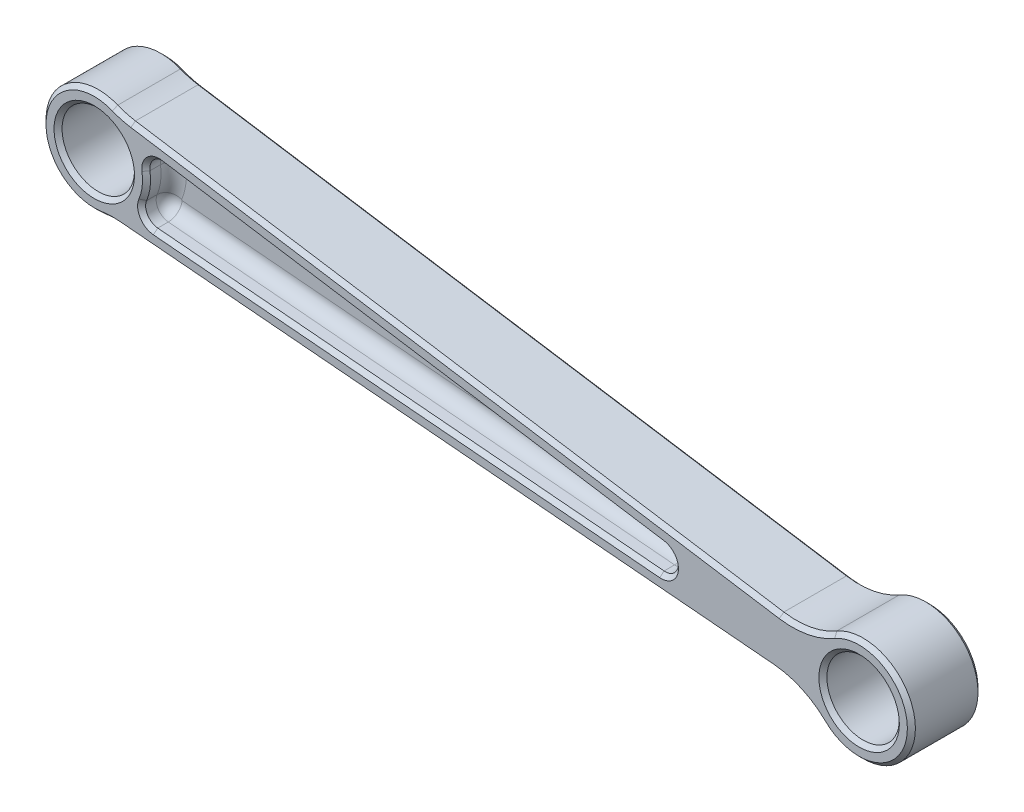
ISO-10303-21;
HEADER;
FILE_DESCRIPTION(('STEP AP214'),'2;1');
FILE_NAME('part.step','',(''),(''),'','','');
FILE_SCHEMA(('AUTOMOTIVE_DESIGN { 1 0 10303 214 1 1 1 1 }'));
ENDSEC;
DATA;
#1=APPLICATION_CONTEXT('core data for automotive mechanical design processes');
#2=APPLICATION_PROTOCOL_DEFINITION('international standard','automotive_design',2000,#1);
#3=PRODUCT_CONTEXT('',#1,'mechanical');
#4=PRODUCT('Part','Part','',(#3));
#5=PRODUCT_RELATED_PRODUCT_CATEGORY('part','',(#4));
#6=PRODUCT_DEFINITION_FORMATION('','',#4);
#7=PRODUCT_DEFINITION_CONTEXT('part definition',#1,'design');
#8=PRODUCT_DEFINITION('design','',#6,#7);
#9=PRODUCT_DEFINITION_SHAPE('','',#8);
#10=(LENGTH_UNIT() NAMED_UNIT(*) SI_UNIT(.MILLI.,.METRE.));
#11=(NAMED_UNIT(*) PLANE_ANGLE_UNIT() SI_UNIT($,.RADIAN.));
#12=(NAMED_UNIT(*) SI_UNIT($,.STERADIAN.) SOLID_ANGLE_UNIT());
#13=UNCERTAINTY_MEASURE_WITH_UNIT(LENGTH_MEASURE(1.E-05),#10,'distance_accuracy_value','');
#14=(GEOMETRIC_REPRESENTATION_CONTEXT(3) GLOBAL_UNCERTAINTY_ASSIGNED_CONTEXT((#13)) GLOBAL_UNIT_ASSIGNED_CONTEXT((#10,
#11,#12)) REPRESENTATION_CONTEXT('',''));
#15=CARTESIAN_POINT('',(0.,0.,0.));
#16=DIRECTION('',(0.,0.,1.));
#17=DIRECTION('',(1.,0.,0.));
#18=AXIS2_PLACEMENT_3D('',#15,#16,#17);
#19=CARTESIAN_POINT('',(3.28047067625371,-22.13588363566,29.8));
#20=DIRECTION('',(0.,0.,-1.));
#21=DIRECTION('',(0.,1.,0.));
#22=AXIS2_PLACEMENT_3D('',#19,#20,#21);
#23=PLANE('',#22);
#24=CARTESIAN_POINT('',(99.5403612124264,-38.0849425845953,29.8));
#25=DIRECTION('',(0.,0.,-1.));
#26=DIRECTION('',(0.,1.,0.));
#27=AXIS2_PLACEMENT_3D('',#24,#25,#26);
#28=CIRCLE('',#27,5.0127);
#29=CARTESIAN_POINT('',(99.5403612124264,-33.0722425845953,29.8));
#30=VERTEX_POINT('',#29);
#31=EDGE_CURVE('E532',#30,#30,#28,.T.);
#32=ORIENTED_EDGE('',*,*,#31,.T.);
#33=EDGE_LOOP('',(#32));
#34=FACE_BOUND('',#33,.T.);
#35=DIRECTION('',(-0.996279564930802,0.0861802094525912,0.));
#36=VECTOR('',#35,1.);
#37=CARTESIAN_POINT('',(11.6040198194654,-31.7837182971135,29.8));
#38=LINE('',#37,#36);
#39=CARTESIAN_POINT('',(74.6933998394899,-37.2410780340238,29.8));
#40=VERTEX_POINT('',#39);
#41=CARTESIAN_POINT('',(11.6040198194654,-31.7837182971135,29.8));
#42=VERTEX_POINT('',#41);
#43=EDGE_CURVE('E527',#40,#42,#38,.T.);
#44=ORIENTED_EDGE('',*,*,#43,.T.);
#45=CARTESIAN_POINT('',(11.7893072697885,-29.6417172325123,29.8));
#46=DIRECTION('',(0.,0.,-1.));
#47=DIRECTION('',(0.,1.,0.));
#48=AXIS2_PLACEMENT_3D('',#45,#46,#47);
#49=CIRCLE('',#48,2.14999999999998);
#50=CARTESIAN_POINT('',(9.79990581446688,-28.8263756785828,29.8));
#51=VERTEX_POINT('',#50);
#52=EDGE_CURVE('E529',#42,#51,#49,.T.);
#53=ORIENTED_EDGE('',*,*,#52,.T.);
#54=CARTESIAN_POINT('',(4.23633645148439,-26.5461876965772,29.8));
#55=DIRECTION('',(0.,0.,-1.));
#56=DIRECTION('',(0.,1.,0.));
#57=AXIS2_PLACEMENT_3D('',#54,#55,#56);
#58=CIRCLE('',#57,6.01270000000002);
#59=CARTESIAN_POINT('',(10.1833150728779,-25.6596175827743,29.8));
#60=VERTEX_POINT('',#59);
#61=EDGE_CURVE('E525',#51,#60,#58,.F.);
#62=ORIENTED_EDGE('',*,*,#61,.T.);
#63=CARTESIAN_POINT('',(12.3098146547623,-25.3426009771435,29.8));
#64=DIRECTION('',(0.,0.,-1.));
#65=DIRECTION('',(0.,1.,0.));
#66=AXIS2_PLACEMENT_3D('',#63,#64,#65);
#67=CIRCLE('',#66,2.14999999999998);
#68=CARTESIAN_POINT('',(12.6410650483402,-23.2182721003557,29.8));
#69=VERTEX_POINT('',#68);
#70=EDGE_CURVE('E521',#60,#69,#67,.T.);
#71=ORIENTED_EDGE('',*,*,#70,.T.);
#72=DIRECTION('',(0.988059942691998,-0.154069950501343,0.));
#73=VECTOR('',#72,1.);
#74=CARTESIAN_POINT('',(75.2099376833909,-32.9747480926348,29.8));
#75=LINE('',#74,#73);
#76=CARTESIAN_POINT('',(75.2099376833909,-32.9747480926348,29.8));
#77=VERTEX_POINT('',#76);
#78=EDGE_CURVE('E519',#69,#77,#75,.T.);
#79=ORIENTED_EDGE('',*,*,#78,.T.);
#80=CARTESIAN_POINT('',(74.878687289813,-35.0990769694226,29.8));
#81=DIRECTION('',(0.,0.,-1.));
#82=DIRECTION('',(0.,1.,0.));
#83=AXIS2_PLACEMENT_3D('',#80,#81,#82);
#84=CIRCLE('',#83,2.14999999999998);
#85=EDGE_CURVE('E523',#77,#40,#84,.T.);
#86=ORIENTED_EDGE('',*,*,#85,.T.);
#87=EDGE_LOOP('',(#44,#53,#62,#71,#79,#86));
#88=FACE_BOUND('',#87,.T.);
#89=CARTESIAN_POINT('',(4.23633645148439,-26.5461876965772,29.8));
#90=DIRECTION('',(0.,0.,-1.));
#91=DIRECTION('',(0.,1.,0.));
#92=AXIS2_PLACEMENT_3D('',#89,#90,#91);
#93=CIRCLE('',#92,5.01270000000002);
#94=CARTESIAN_POINT('',(4.23633645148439,-21.5334876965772,29.8));
#95=VERTEX_POINT('',#94);
#96=EDGE_CURVE('E516',#95,#95,#93,.T.);
#97=ORIENTED_EDGE('',*,*,#96,.T.);
#98=EDGE_LOOP('',(#97));
#99=FACE_BOUND('',#98,.T.);
#100=CARTESIAN_POINT('',(88.0446121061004,-49.9389298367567,29.8));
#101=DIRECTION('',(0.,0.,-1.));
#102=DIRECTION('',(0.,1.,0.));
#103=AXIS2_PLACEMENT_3D('',#100,#101,#102);
#104=CIRCLE('',#103,10.5);
#105=CARTESIAN_POINT('',(88.9495043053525,-39.4779944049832,29.8));
#106=VERTEX_POINT('',#105);
#107=CARTESIAN_POINT('',(95.3544624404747,-42.4012851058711,29.8));
#108=VERTEX_POINT('',#107);
#109=EDGE_CURVE('E511',#106,#108,#104,.T.);
#110=ORIENTED_EDGE('',*,*,#109,.T.);
#111=CARTESIAN_POINT('',(99.5403612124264,-38.0849425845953,29.8));
#112=DIRECTION('',(0.,0.,-1.));
#113=DIRECTION('',(0.,1.,0.));
#114=AXIS2_PLACEMENT_3D('',#111,#112,#113);
#115=CIRCLE('',#114,6.0127);
#116=CARTESIAN_POINT('',(96.5054954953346,-32.894359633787,29.8));
#117=VERTEX_POINT('',#116);
#118=EDGE_CURVE('E513',#108,#117,#115,.F.);
#119=ORIENTED_EDGE('',*,*,#118,.T.);
#120=CARTESIAN_POINT('',(91.2056983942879,-23.8300256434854,29.8));
#121=DIRECTION('',(0.,0.,-1.));
#122=DIRECTION('',(0.,1.,0.));
#123=AXIS2_PLACEMENT_3D('',#120,#121,#122);
#124=CIRCLE('',#123,10.5);
#125=CARTESIAN_POINT('',(89.5879639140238,-34.2046550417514,29.8));
#126=VERTEX_POINT('',#125);
#127=EDGE_CURVE('E509',#117,#126,#124,.T.);
#128=ORIENTED_EDGE('',*,*,#127,.T.);
#129=DIRECTION('',(-0.988059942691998,0.154069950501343,0.));
#130=VECTOR('',#129,1.);
#131=CARTESIAN_POINT('',(3.49196582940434,-20.7795523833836,29.8));
#132=LINE('',#131,#130);
#133=CARTESIAN_POINT('',(8.79393831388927,-21.606298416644,29.8));
#134=VERTEX_POINT('',#133);
#135=EDGE_CURVE('E505',#126,#134,#132,.T.);
#136=ORIENTED_EDGE('',*,*,#135,.T.);
#137=CARTESIAN_POINT('',(10.4116727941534,-11.231669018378,29.8));
#138=DIRECTION('',(0.,0.,-1.));
#139=DIRECTION('',(0.,1.,0.));
#140=AXIS2_PLACEMENT_3D('',#137,#138,#139);
#141=CIRCLE('',#140,10.5);
#142=CARTESIAN_POINT('',(6.48493570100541,-20.9697764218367,29.8));
#143=VERTEX_POINT('',#142);
#144=EDGE_CURVE('E501',#134,#143,#141,.T.);
#145=ORIENTED_EDGE('',*,*,#144,.T.);
#146=CARTESIAN_POINT('',(4.23633645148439,-26.5461876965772,29.8));
#147=DIRECTION('',(0.,0.,-1.));
#148=DIRECTION('',(0.,1.,0.));
#149=AXIS2_PLACEMENT_3D('',#146,#147,#148);
#150=CIRCLE('',#149,6.01269999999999);
#151=CARTESIAN_POINT('',(5.08916585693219,-32.4980985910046,29.8));
#152=VERTEX_POINT('',#151);
#153=EDGE_CURVE('E499',#143,#152,#150,.F.);
#154=ORIENTED_EDGE('',*,*,#153,.T.);
#155=CARTESIAN_POINT('',(6.57846496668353,-42.8919423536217,29.8));
#156=DIRECTION('',(0.,0.,-1.));
#157=DIRECTION('',(0.,1.,0.));
#158=AXIS2_PLACEMENT_3D('',#155,#156,#157);
#159=CIRCLE('',#158,10.5);
#160=CARTESIAN_POINT('',(7.48335716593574,-32.4310069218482,29.8));
#161=VERTEX_POINT('',#160);
#162=EDGE_CURVE('E503',#152,#161,#159,.T.);
#163=ORIENTED_EDGE('',*,*,#162,.T.);
#164=DIRECTION('',(0.996279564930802,-0.0861802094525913,0.));
#165=VECTOR('',#164,1.);
#166=CARTESIAN_POINT('',(2.42775065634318,-31.9936866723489,29.8));
#167=LINE('',#166,#165);
#168=EDGE_CURVE('E507',#161,#106,#167,.T.);
#169=ORIENTED_EDGE('',*,*,#168,.T.);
#170=EDGE_LOOP('',(#110,#119,#128,#136,#145,#154,#163,#169));
#171=FACE_BOUND('',#170,.T.);
#172=ADVANCED_FACE('F35',(#34,#88,#99,#171),#23,.F.);
#173=CARTESIAN_POINT('',(4.23633645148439,-26.5461876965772,0.));
#174=DIRECTION('',(0.,0.,-1.));
#175=DIRECTION('',(0.,1.,0.));
#176=AXIS2_PLACEMENT_3D('',#173,#174,#175);
#177=CYLINDRICAL_SURFACE('',#176,6.51270000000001);
#178=DIRECTION('',(0.,0.,-1.));
#179=VECTOR('',#178,1.);
#180=CARTESIAN_POINT('',(6.67192318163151,-20.5060570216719,0.));
#181=LINE('',#180,#179);
#182=CARTESIAN_POINT('',(6.67192318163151,-20.5060570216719,29.3));
#183=VERTEX_POINT('',#182);
#184=CARTESIAN_POINT('',(6.67192318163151,-20.5060570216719,21.5));
#185=VERTEX_POINT('',#184);
#186=EDGE_CURVE('E635',#183,#185,#181,.T.);
#187=ORIENTED_EDGE('',*,*,#186,.T.);
#188=CARTESIAN_POINT('',(4.23633645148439,-26.5461876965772,21.5));
#189=DIRECTION('',(0.,0.,1.));
#190=DIRECTION('',(1.,0.,0.));
#191=AXIS2_PLACEMENT_3D('',#188,#189,#190);
#192=CIRCLE('',#191,6.51270000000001);
#193=CARTESIAN_POINT('',(5.16008486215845,-32.9930435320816,21.5));
#194=VERTEX_POINT('',#193);
#195=EDGE_CURVE('E482',#185,#194,#192,.T.);
#196=ORIENTED_EDGE('',*,*,#195,.T.);
#197=DIRECTION('',(0.,0.,-1.));
#198=VECTOR('',#197,1.);
#199=CARTESIAN_POINT('',(5.16008486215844,-32.9930435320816,0.));
#200=LINE('',#199,#198);
#201=CARTESIAN_POINT('',(5.16008486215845,-32.9930435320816,29.3));
#202=VERTEX_POINT('',#201);
#203=EDGE_CURVE('E638',#194,#202,#200,.F.);
#204=ORIENTED_EDGE('',*,*,#203,.T.);
#205=CARTESIAN_POINT('',(4.23633645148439,-26.5461876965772,29.3));
#206=DIRECTION('',(0.,0.,-1.));
#207=DIRECTION('',(-1.,0.,0.));
#208=AXIS2_PLACEMENT_3D('',#205,#206,#207);
#209=CIRCLE('',#208,6.51270000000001);
#210=EDGE_CURVE('E480',#202,#183,#209,.T.);
#211=ORIENTED_EDGE('',*,*,#210,.T.);
#212=EDGE_LOOP('',(#187,#196,#204,#211));
#213=FACE_BOUND('',#212,.T.);
#214=ADVANCED_FACE('F634',(#213),#177,.T.);
#215=CARTESIAN_POINT('',(3.28047067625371,-22.13588363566,21.8));
#216=DIRECTION('',(0.,0.,-1.));
#217=DIRECTION('',(0.,1.,0.));
#218=AXIS2_PLACEMENT_3D('',#215,#216,#217);
#219=PLANE('',#218);
#220=CARTESIAN_POINT('',(4.23633645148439,-26.5461876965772,21.8));
#221=DIRECTION('',(0.,0.,-1.));
#222=DIRECTION('',(0.,1.,0.));
#223=AXIS2_PLACEMENT_3D('',#220,#221,#222);
#224=CIRCLE('',#223,4.5127);
#225=CARTESIAN_POINT('',(4.23633645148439,-22.0334876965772,21.8));
#226=VERTEX_POINT('',#225);
#227=EDGE_CURVE('E1400',#226,#226,#224,.T.);
#228=ORIENTED_EDGE('',*,*,#227,.F.);
#229=EDGE_LOOP('',(#228));
#230=FACE_BOUND('',#229,.T.);
#231=CARTESIAN_POINT('',(4.23633645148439,-26.5461876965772,21.8));
#232=DIRECTION('',(0.,0.,-1.));
#233=DIRECTION('',(0.,1.,0.));
#234=AXIS2_PLACEMENT_3D('',#231,#232,#233);
#235=CIRCLE('',#234,3.71270000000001);
#236=CARTESIAN_POINT('',(4.23633645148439,-22.8334876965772,21.8));
#237=VERTEX_POINT('',#236);
#238=EDGE_CURVE('E701',#237,#237,#235,.T.);
#239=ORIENTED_EDGE('',*,*,#238,.T.);
#240=EDGE_LOOP('',(#239));
#241=FACE_BOUND('',#240,.T.);
#242=ADVANCED_FACE('F712',(#230,#241),#219,.F.);
#243=CARTESIAN_POINT('',(4.23633645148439,-26.5461876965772,0.));
#244=DIRECTION('',(0.,0.,-1.));
#245=DIRECTION('',(0.,1.,0.));
#246=AXIS2_PLACEMENT_3D('',#243,#244,#245);
#247=CYLINDRICAL_SURFACE('',#246,3.71270000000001);
#248=ORIENTED_EDGE('',*,*,#238,.F.);
#249=EDGE_LOOP('',(#248));
#250=FACE_BOUND('',#249,.T.);
#251=CARTESIAN_POINT('',(4.23633645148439,-26.5461876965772,21.));
#252=DIRECTION('',(0.,0.,-1.));
#253=DIRECTION('',(0.,1.,0.));
#254=AXIS2_PLACEMENT_3D('',#251,#252,#253);
#255=CIRCLE('',#254,3.71270000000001);
#256=CARTESIAN_POINT('',(4.23633645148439,-22.8334876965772,21.));
#257=VERTEX_POINT('',#256);
#258=EDGE_CURVE('E1401',#257,#257,#255,.T.);
#259=ORIENTED_EDGE('',*,*,#258,.T.);
#260=EDGE_LOOP('',(#259));
#261=FACE_BOUND('',#260,.T.);
#262=ADVANCED_FACE('F722',(#250,#261),#247,.F.);
#263=CARTESIAN_POINT('',(2.85683703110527,-20.1812648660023,21.));
#264=DIRECTION('',(0.,0.,1.));
#265=DIRECTION('',(0.,-1.,0.));
#266=AXIS2_PLACEMENT_3D('',#263,#264,#265);
#267=PLANE('',#266);
#268=CARTESIAN_POINT('',(4.23633645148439,-26.5461876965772,21.));
#269=DIRECTION('',(0.,0.,1.));
#270=DIRECTION('',(0.,-1.,0.));
#271=AXIS2_PLACEMENT_3D('',#268,#269,#270);
#272=CIRCLE('',#271,6.01269999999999);
#273=CARTESIAN_POINT('',(10.1833150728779,-25.6596175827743,21.));
#274=VERTEX_POINT('',#273);
#275=CARTESIAN_POINT('',(9.79990581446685,-28.8263756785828,21.));
#276=VERTEX_POINT('',#275);
#277=EDGE_CURVE('E443',#274,#276,#272,.F.);
#278=ORIENTED_EDGE('',*,*,#277,.T.);
#279=CARTESIAN_POINT('',(11.7893072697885,-29.6417172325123,21.));
#280=DIRECTION('',(0.,0.,1.));
#281=DIRECTION('',(0.,-1.,0.));
#282=AXIS2_PLACEMENT_3D('',#279,#280,#281);
#283=CIRCLE('',#282,2.15000000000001);
#284=CARTESIAN_POINT('',(11.6040198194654,-31.7837182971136,21.));
#285=VERTEX_POINT('',#284);
#286=EDGE_CURVE('E447',#276,#285,#283,.T.);
#287=ORIENTED_EDGE('',*,*,#286,.T.);
#288=DIRECTION('',(0.996279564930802,-0.0861802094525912,0.));
#289=VECTOR('',#288,1.);
#290=CARTESIAN_POINT('',(1.92562081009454,-30.9465170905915,21.));
#291=LINE('',#290,#289);
#292=CARTESIAN_POINT('',(74.6933998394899,-37.2410780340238,21.));
#293=VERTEX_POINT('',#292);
#294=EDGE_CURVE('E445',#285,#293,#291,.T.);
#295=ORIENTED_EDGE('',*,*,#294,.T.);
#296=CARTESIAN_POINT('',(74.878687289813,-35.0990769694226,21.));
#297=DIRECTION('',(0.,0.,1.));
#298=DIRECTION('',(0.,-1.,0.));
#299=AXIS2_PLACEMENT_3D('',#296,#297,#298);
#300=CIRCLE('',#299,2.15000000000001);
#301=CARTESIAN_POINT('',(75.2099376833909,-32.9747480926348,21.));
#302=VERTEX_POINT('',#301);
#303=EDGE_CURVE('E441',#293,#302,#300,.T.);
#304=ORIENTED_EDGE('',*,*,#303,.T.);
#305=DIRECTION('',(-0.988059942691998,0.154069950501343,0.));
#306=VECTOR('',#305,1.);
#307=CARTESIAN_POINT('',(2.62676596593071,-21.6567245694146,21.));
#308=LINE('',#307,#306);
#309=CARTESIAN_POINT('',(12.6410650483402,-23.2182721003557,21.));
#310=VERTEX_POINT('',#309);
#311=EDGE_CURVE('E437',#302,#310,#308,.T.);
#312=ORIENTED_EDGE('',*,*,#311,.T.);
#313=CARTESIAN_POINT('',(12.3098146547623,-25.3426009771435,21.));
#314=DIRECTION('',(0.,0.,1.));
#315=DIRECTION('',(0.,-1.,0.));
#316=AXIS2_PLACEMENT_3D('',#313,#314,#315);
#317=CIRCLE('',#316,2.15000000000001);
#318=EDGE_CURVE('E439',#310,#274,#317,.T.);
#319=ORIENTED_EDGE('',*,*,#318,.T.);
#320=EDGE_LOOP('',(#278,#287,#295,#304,#312,#319));
#321=FACE_BOUND('',#320,.T.);
#322=CARTESIAN_POINT('',(88.0446121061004,-49.9389298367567,21.));
#323=DIRECTION('',(0.,0.,1.));
#324=DIRECTION('',(0.,-1.,0.));
#325=AXIS2_PLACEMENT_3D('',#322,#323,#324);
#326=CIRCLE('',#325,10.5);
#327=CARTESIAN_POINT('',(95.3544624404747,-42.4012851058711,21.));
#328=VERTEX_POINT('',#327);
#329=CARTESIAN_POINT('',(88.9495043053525,-39.4779944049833,21.));
#330=VERTEX_POINT('',#329);
#331=EDGE_CURVE('E432',#328,#330,#326,.T.);
#332=ORIENTED_EDGE('',*,*,#331,.T.);
#333=DIRECTION('',(-0.996279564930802,0.0861802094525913,0.));
#334=VECTOR('',#333,1.);
#335=CARTESIAN_POINT('',(1.83944060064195,-31.9427966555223,21.));
#336=LINE('',#335,#334);
#337=CARTESIAN_POINT('',(7.48335716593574,-32.4310069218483,21.));
#338=VERTEX_POINT('',#337);
#339=EDGE_CURVE('E434',#330,#338,#336,.T.);
#340=ORIENTED_EDGE('',*,*,#339,.T.);
#341=CARTESIAN_POINT('',(6.57846496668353,-42.8919423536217,21.));
#342=DIRECTION('',(0.,0.,1.));
#343=DIRECTION('',(0.,-1.,0.));
#344=AXIS2_PLACEMENT_3D('',#341,#342,#343);
#345=CIRCLE('',#344,10.5);
#346=CARTESIAN_POINT('',(5.08916585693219,-32.4980985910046,21.));
#347=VERTEX_POINT('',#346);
#348=EDGE_CURVE('E430',#338,#347,#345,.T.);
#349=ORIENTED_EDGE('',*,*,#348,.T.);
#350=CARTESIAN_POINT('',(4.23633645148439,-26.5461876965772,21.));
#351=DIRECTION('',(0.,0.,1.));
#352=DIRECTION('',(0.,-1.,0.));
#353=AXIS2_PLACEMENT_3D('',#350,#351,#352);
#354=CIRCLE('',#353,6.01270000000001);
#355=CARTESIAN_POINT('',(6.48493570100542,-20.9697764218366,21.));
#356=VERTEX_POINT('',#355);
#357=EDGE_CURVE('E426',#347,#356,#354,.F.);
#358=ORIENTED_EDGE('',*,*,#357,.T.);
#359=CARTESIAN_POINT('',(10.4116727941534,-11.231669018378,21.));
#360=DIRECTION('',(0.,0.,1.));
#361=DIRECTION('',(0.,-1.,0.));
#362=AXIS2_PLACEMENT_3D('',#359,#360,#361);
#363=CIRCLE('',#362,10.5);
#364=CARTESIAN_POINT('',(8.79393831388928,-21.606298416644,21.));
#365=VERTEX_POINT('',#364);
#366=EDGE_CURVE('E422',#356,#365,#363,.T.);
#367=ORIENTED_EDGE('',*,*,#366,.T.);
#368=DIRECTION('',(0.988059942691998,-0.154069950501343,0.));
#369=VECTOR('',#368,1.);
#370=CARTESIAN_POINT('',(2.78083591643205,-20.6686646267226,21.));
#371=LINE('',#370,#369);
#372=CARTESIAN_POINT('',(89.5879639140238,-34.2046550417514,21.));
#373=VERTEX_POINT('',#372);
#374=EDGE_CURVE('E390',#365,#373,#371,.T.);
#375=ORIENTED_EDGE('',*,*,#374,.T.);
#376=CARTESIAN_POINT('',(91.2056983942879,-23.8300256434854,21.));
#377=DIRECTION('',(0.,0.,1.));
#378=DIRECTION('',(0.,-1.,0.));
#379=AXIS2_PLACEMENT_3D('',#376,#377,#378);
#380=CIRCLE('',#379,10.5);
#381=CARTESIAN_POINT('',(96.5054954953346,-32.894359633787,21.));
#382=VERTEX_POINT('',#381);
#383=EDGE_CURVE('E424',#373,#382,#380,.T.);
#384=ORIENTED_EDGE('',*,*,#383,.T.);
#385=CARTESIAN_POINT('',(99.5403612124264,-38.0849425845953,21.));
#386=DIRECTION('',(0.,0.,1.));
#387=DIRECTION('',(0.,-1.,0.));
#388=AXIS2_PLACEMENT_3D('',#385,#386,#387);
#389=CIRCLE('',#388,6.01270000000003);
#390=EDGE_CURVE('E428',#382,#328,#389,.F.);
#391=ORIENTED_EDGE('',*,*,#390,.T.);
#392=EDGE_LOOP('',(#332,#340,#349,#358,#367,#375,#384,#391));
#393=FACE_BOUND('',#392,.T.);
#394=ORIENTED_EDGE('',*,*,#258,.F.);
#395=EDGE_LOOP('',(#394));
#396=FACE_BOUND('',#395,.T.);
#397=CARTESIAN_POINT('',(99.5403612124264,-38.0849425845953,21.));
#398=DIRECTION('',(0.,0.,1.));
#399=DIRECTION('',(0.,-1.,0.));
#400=AXIS2_PLACEMENT_3D('',#397,#398,#399);
#401=CIRCLE('',#400,3.71270000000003);
#402=CARTESIAN_POINT('',(99.5403612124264,-41.7976425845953,21.));
#403=VERTEX_POINT('',#402);
#404=EDGE_CURVE('E1407',#403,#403,#401,.T.);
#405=ORIENTED_EDGE('',*,*,#404,.T.);
#406=EDGE_LOOP('',(#405));
#407=FACE_BOUND('',#406,.T.);
#408=ADVANCED_FACE('F719',(#321,#393,#396,#407),#267,.F.);
#409=CARTESIAN_POINT('',(4.23633645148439,-26.5461876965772,0.));
#410=DIRECTION('',(0.,0.,-1.));
#411=DIRECTION('',(0.,1.,0.));
#412=AXIS2_PLACEMENT_3D('',#409,#410,#411);
#413=CYLINDRICAL_SURFACE('',#412,4.5127);
#414=CARTESIAN_POINT('',(4.23633645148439,-26.5461876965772,29.3));
#415=DIRECTION('',(0.,0.,-1.));
#416=DIRECTION('',(-1.,0.,0.));
#417=AXIS2_PLACEMENT_3D('',#414,#415,#416);
#418=CIRCLE('',#417,4.5127);
#419=CARTESIAN_POINT('',(-0.276363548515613,-26.5461876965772,29.3));
#420=VERTEX_POINT('',#419);
#421=EDGE_CURVE('E11',#420,#420,#418,.F.);
#422=ORIENTED_EDGE('',*,*,#421,.T.);
#423=EDGE_LOOP('',(#422));
#424=FACE_BOUND('',#423,.T.);
#425=ORIENTED_EDGE('',*,*,#227,.T.);
#426=EDGE_LOOP('',(#425));
#427=FACE_BOUND('',#426,.T.);
#428=ADVANCED_FACE('F716',(#424,#427),#413,.F.);
#429=CARTESIAN_POINT('',(6.02963846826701,-32.8071244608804,29.8));
#430=DIRECTION('',(0.0861802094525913,0.996279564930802,0.));
#431=DIRECTION('',(-0.996279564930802,0.0861802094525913,0.));
#432=AXIS2_PLACEMENT_3D('',#429,#430,#431);
#433=PLANE('',#432);
#434=DIRECTION('',(0.,0.,1.));
#435=VECTOR('',#434,1.);
#436=CARTESIAN_POINT('',(7.44026706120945,-32.9291467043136,21.));
#437=LINE('',#436,#435);
#438=CARTESIAN_POINT('',(7.44026706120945,-32.9291467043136,29.3));
#439=VERTEX_POINT('',#438);
#440=CARTESIAN_POINT('',(7.44026706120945,-32.9291467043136,21.5));
#441=VERTEX_POINT('',#440);
#442=EDGE_CURVE('E644',#439,#441,#437,.F.);
#443=ORIENTED_EDGE('',*,*,#442,.T.);
#444=DIRECTION('',(0.996279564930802,-0.0861802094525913,0.));
#445=VECTOR('',#444,1.);
#446=CARTESIAN_POINT('',(6.02963846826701,-32.8071244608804,21.5));
#447=LINE('',#446,#445);
#448=CARTESIAN_POINT('',(88.9064142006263,-39.9761341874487,21.5));
#449=VERTEX_POINT('',#448);
#450=EDGE_CURVE('E464',#441,#449,#447,.T.);
#451=ORIENTED_EDGE('',*,*,#450,.T.);
#452=DIRECTION('',(0.,0.,1.));
#453=VECTOR('',#452,1.);
#454=CARTESIAN_POINT('',(88.9064142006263,-39.9761341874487,29.8));
#455=LINE('',#454,#453);
#456=CARTESIAN_POINT('',(88.9064142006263,-39.9761341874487,29.3));
#457=VERTEX_POINT('',#456);
#458=EDGE_CURVE('E649',#449,#457,#455,.T.);
#459=ORIENTED_EDGE('',*,*,#458,.T.);
#460=DIRECTION('',(-0.996279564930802,0.0861802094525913,0.));
#461=VECTOR('',#460,1.);
#462=CARTESIAN_POINT('',(6.02963846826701,-32.8071244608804,29.3));
#463=LINE('',#462,#461);
#464=EDGE_CURVE('E462',#457,#439,#463,.T.);
#465=ORIENTED_EDGE('',*,*,#464,.T.);
#466=EDGE_LOOP('',(#443,#451,#459,#465));
#467=FACE_BOUND('',#466,.T.);
#468=ADVANCED_FACE('F698',(#467),#433,.F.);
#469=CARTESIAN_POINT('',(7.47198282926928,-20.8941213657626,29.8));
#470=DIRECTION('',(-0.154069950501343,-0.988059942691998,0.));
#471=DIRECTION('',(0.988059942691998,-0.154069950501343,0.));
#472=AXIS2_PLACEMENT_3D('',#469,#470,#471);
#473=PLANE('',#472);
#474=DIRECTION('',(0.,0.,1.));
#475=VECTOR('',#474,1.);
#476=CARTESIAN_POINT('',(89.6649988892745,-33.7106250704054,29.8));
#477=LINE('',#476,#475);
#478=CARTESIAN_POINT('',(89.6649988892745,-33.7106250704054,29.3));
#479=VERTEX_POINT('',#478);
#480=CARTESIAN_POINT('',(89.6649988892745,-33.7106250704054,21.5));
#481=VERTEX_POINT('',#480);
#482=EDGE_CURVE('E333',#479,#481,#477,.F.);
#483=ORIENTED_EDGE('',*,*,#482,.T.);
#484=DIRECTION('',(-0.988059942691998,0.154069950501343,0.));
#485=VECTOR('',#484,1.);
#486=CARTESIAN_POINT('',(7.47198282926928,-20.8941213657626,21.5));
#487=LINE('',#486,#485);
#488=CARTESIAN_POINT('',(8.87097328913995,-21.112268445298,21.5));
#489=VERTEX_POINT('',#488);
#490=EDGE_CURVE('E494',#481,#489,#487,.T.);
#491=ORIENTED_EDGE('',*,*,#490,.T.);
#492=DIRECTION('',(0.,0.,1.));
#493=VECTOR('',#492,1.);
#494=CARTESIAN_POINT('',(8.87097328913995,-21.112268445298,29.8));
#495=LINE('',#494,#493);
#496=CARTESIAN_POINT('',(8.87097328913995,-21.112268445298,29.3));
#497=VERTEX_POINT('',#496);
#498=EDGE_CURVE('E338',#489,#497,#495,.T.);
#499=ORIENTED_EDGE('',*,*,#498,.T.);
#500=DIRECTION('',(0.988059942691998,-0.154069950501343,0.));
#501=VECTOR('',#500,1.);
#502=CARTESIAN_POINT('',(7.47198282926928,-20.8941213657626,29.3));
#503=LINE('',#502,#501);
#504=EDGE_CURVE('E492',#497,#479,#503,.T.);
#505=ORIENTED_EDGE('',*,*,#504,.T.);
#506=EDGE_LOOP('',(#483,#491,#499,#505));
#507=FACE_BOUND('',#506,.T.);
#508=ADVANCED_FACE('F659',(#507),#473,.F.);
#509=CARTESIAN_POINT('',(99.5403612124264,-38.0849425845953,29.8));
#510=DIRECTION('',(0.,0.,1.));
#511=DIRECTION('',(0.,-1.,0.));
#512=AXIS2_PLACEMENT_3D('',#509,#510,#511);
#513=CYLINDRICAL_SURFACE('',#512,6.51270000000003);
#514=DIRECTION('',(0.,0.,1.));
#515=VECTOR('',#514,1.);
#516=CARTESIAN_POINT('',(95.006374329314,-42.7602205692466,29.8));
#517=LINE('',#516,#515);
#518=CARTESIAN_POINT('',(95.006374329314,-42.7602205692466,29.3));
#519=VERTEX_POINT('',#518);
#520=CARTESIAN_POINT('',(95.006374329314,-42.7602205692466,21.5));
#521=VERTEX_POINT('',#520);
#522=EDGE_CURVE('E655',#519,#521,#517,.F.);
#523=ORIENTED_EDGE('',*,*,#522,.T.);
#524=CARTESIAN_POINT('',(99.5403612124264,-38.0849425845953,21.5));
#525=DIRECTION('',(0.,0.,1.));
#526=DIRECTION('',(1.,0.,0.));
#527=AXIS2_PLACEMENT_3D('',#524,#525,#526);
#528=CIRCLE('',#527,6.51270000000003);
#529=CARTESIAN_POINT('',(96.2531242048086,-32.4627246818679,21.5));
#530=VERTEX_POINT('',#529);
#531=EDGE_CURVE('E478',#521,#530,#528,.T.);
#532=ORIENTED_EDGE('',*,*,#531,.T.);
#533=DIRECTION('',(0.,0.,1.));
#534=VECTOR('',#533,1.);
#535=CARTESIAN_POINT('',(96.2531242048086,-32.4627246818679,29.8));
#536=LINE('',#535,#534);
#537=CARTESIAN_POINT('',(96.2531242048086,-32.4627246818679,29.3));
#538=VERTEX_POINT('',#537);
#539=EDGE_CURVE('E646',#530,#538,#536,.T.);
#540=ORIENTED_EDGE('',*,*,#539,.T.);
#541=CARTESIAN_POINT('',(99.5403612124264,-38.0849425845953,29.3));
#542=DIRECTION('',(0.,0.,-1.));
#543=DIRECTION('',(-1.,0.,0.));
#544=AXIS2_PLACEMENT_3D('',#541,#542,#543);
#545=CIRCLE('',#544,6.51270000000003);
#546=EDGE_CURVE('E475',#538,#519,#545,.T.);
#547=ORIENTED_EDGE('',*,*,#546,.T.);
#548=EDGE_LOOP('',(#523,#532,#540,#547));
#549=FACE_BOUND('',#548,.T.);
#550=ADVANCED_FACE('F680',(#549),#513,.T.);
#551=CARTESIAN_POINT('',(98.5844954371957,-33.6746385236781,21.8));
#552=DIRECTION('',(0.,0.,1.));
#553=DIRECTION('',(0.,-1.,0.));
#554=AXIS2_PLACEMENT_3D('',#551,#552,#553);
#555=PLANE('',#554);
#556=CARTESIAN_POINT('',(99.5403612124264,-38.0849425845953,21.8));
#557=DIRECTION('',(0.,0.,1.));
#558=DIRECTION('',(0.,-1.,0.));
#559=AXIS2_PLACEMENT_3D('',#556,#557,#558);
#560=CIRCLE('',#559,4.51270000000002);
#561=CARTESIAN_POINT('',(99.5403612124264,-42.5976425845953,21.8));
#562=VERTEX_POINT('',#561);
#563=EDGE_CURVE('E1402',#562,#562,#560,.T.);
#564=ORIENTED_EDGE('',*,*,#563,.T.);
#565=EDGE_LOOP('',(#564));
#566=FACE_BOUND('',#565,.T.);
#567=CARTESIAN_POINT('',(99.5403612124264,-38.0849425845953,21.8));
#568=DIRECTION('',(0.,0.,1.));
#569=DIRECTION('',(0.,-1.,0.));
#570=AXIS2_PLACEMENT_3D('',#567,#568,#569);
#571=CIRCLE('',#570,3.71270000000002);
#572=CARTESIAN_POINT('',(99.5403612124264,-41.7976425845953,21.8));
#573=VERTEX_POINT('',#572);
#574=EDGE_CURVE('E1421',#573,#573,#571,.T.);
#575=ORIENTED_EDGE('',*,*,#574,.F.);
#576=EDGE_LOOP('',(#575));
#577=FACE_BOUND('',#576,.T.);
#578=ADVANCED_FACE('F1163',(#566,#577),#555,.T.);
#579=CARTESIAN_POINT('',(99.5403612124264,-38.0849425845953,29.8));
#580=DIRECTION('',(0.,0.,1.));
#581=DIRECTION('',(0.,-1.,0.));
#582=AXIS2_PLACEMENT_3D('',#579,#580,#581);
#583=CYLINDRICAL_SURFACE('',#582,4.51270000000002);
#584=CARTESIAN_POINT('',(99.5403612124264,-38.0849425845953,29.3));
#585=DIRECTION('',(0.,0.,-1.));
#586=DIRECTION('',(-1.,0.,0.));
#587=AXIS2_PLACEMENT_3D('',#584,#585,#586);
#588=CIRCLE('',#587,4.51270000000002);
#589=CARTESIAN_POINT('',(95.0276612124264,-38.0849425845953,29.3));
#590=VERTEX_POINT('',#589);
#591=EDGE_CURVE('E496',#590,#590,#588,.F.);
#592=ORIENTED_EDGE('',*,*,#591,.T.);
#593=EDGE_LOOP('',(#592));
#594=FACE_BOUND('',#593,.T.);
#595=ORIENTED_EDGE('',*,*,#563,.F.);
#596=EDGE_LOOP('',(#595));
#597=FACE_BOUND('',#596,.T.);
#598=ADVANCED_FACE('F1155',(#594,#597),#583,.F.);
#599=CARTESIAN_POINT('',(99.5403612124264,-38.0849425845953,29.8));
#600=DIRECTION('',(0.,0.,1.));
#601=DIRECTION('',(0.,-1.,0.));
#602=AXIS2_PLACEMENT_3D('',#599,#600,#601);
#603=CYLINDRICAL_SURFACE('',#602,3.71270000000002);
#604=ORIENTED_EDGE('',*,*,#574,.T.);
#605=EDGE_LOOP('',(#604));
#606=FACE_BOUND('',#605,.T.);
#607=ORIENTED_EDGE('',*,*,#404,.F.);
#608=EDGE_LOOP('',(#607));
#609=FACE_BOUND('',#608,.T.);
#610=ADVANCED_FACE('F733',(#606,#609),#603,.F.);
#611=CARTESIAN_POINT('',(6.57846496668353,-42.8919423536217,0.));
#612=DIRECTION('',(0.,0.,-1.));
#613=DIRECTION('',(0.,1.,0.));
#614=AXIS2_PLACEMENT_3D('',#611,#612,#613);
#615=CYLINDRICAL_SURFACE('',#614,10.);
#616=ORIENTED_EDGE('',*,*,#203,.F.);
#617=CARTESIAN_POINT('',(6.57846496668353,-42.8919423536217,21.5));
#618=DIRECTION('',(0.,0.,1.));
#619=DIRECTION('',(1.,0.,0.));
#620=AXIS2_PLACEMENT_3D('',#617,#618,#619);
#621=CIRCLE('',#620,10.);
#622=EDGE_CURVE('E473',#194,#441,#621,.F.);
#623=ORIENTED_EDGE('',*,*,#622,.T.);
#624=ORIENTED_EDGE('',*,*,#442,.F.);
#625=CARTESIAN_POINT('',(6.57846496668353,-42.8919423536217,29.3));
#626=DIRECTION('',(0.,0.,-1.));
#627=DIRECTION('',(-1.,0.,0.));
#628=AXIS2_PLACEMENT_3D('',#625,#626,#627);
#629=CIRCLE('',#628,10.);
#630=EDGE_CURVE('E471',#439,#202,#629,.F.);
#631=ORIENTED_EDGE('',*,*,#630,.T.);
#632=EDGE_LOOP('',(#616,#623,#624,#631));
#633=FACE_BOUND('',#632,.T.);
#634=ADVANCED_FACE('F730',(#633),#615,.F.);
#635=CARTESIAN_POINT('',(88.0446121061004,-49.9389298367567,29.8));
#636=DIRECTION('',(0.,0.,1.));
#637=DIRECTION('',(0.,-1.,0.));
#638=AXIS2_PLACEMENT_3D('',#635,#636,#637);
#639=CYLINDRICAL_SURFACE('',#638,10.);
#640=ORIENTED_EDGE('',*,*,#458,.F.);
#641=CARTESIAN_POINT('',(88.0446121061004,-49.9389298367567,21.5));
#642=DIRECTION('',(0.,0.,1.));
#643=DIRECTION('',(1.,0.,0.));
#644=AXIS2_PLACEMENT_3D('',#641,#642,#643);
#645=CIRCLE('',#644,10.);
#646=EDGE_CURVE('E469',#449,#521,#645,.F.);
#647=ORIENTED_EDGE('',*,*,#646,.T.);
#648=ORIENTED_EDGE('',*,*,#522,.F.);
#649=CARTESIAN_POINT('',(88.0446121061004,-49.9389298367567,29.3));
#650=DIRECTION('',(0.,0.,-1.));
#651=DIRECTION('',(-1.,0.,0.));
#652=AXIS2_PLACEMENT_3D('',#649,#650,#651);
#653=CIRCLE('',#652,10.);
#654=EDGE_CURVE('E467',#519,#457,#653,.F.);
#655=ORIENTED_EDGE('',*,*,#654,.T.);
#656=EDGE_LOOP('',(#640,#647,#648,#655));
#657=FACE_BOUND('',#656,.T.);
#658=ADVANCED_FACE('F695',(#657),#639,.F.);
#659=CARTESIAN_POINT('',(91.2056983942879,-23.8300256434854,29.8));
#660=DIRECTION('',(0.,0.,1.));
#661=DIRECTION('',(0.,-1.,0.));
#662=AXIS2_PLACEMENT_3D('',#659,#660,#661);
#663=CYLINDRICAL_SURFACE('',#662,10.);
#664=ORIENTED_EDGE('',*,*,#539,.F.);
#665=CARTESIAN_POINT('',(91.2056983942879,-23.8300256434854,21.5));
#666=DIRECTION('',(0.,0.,1.));
#667=DIRECTION('',(1.,0.,0.));
#668=AXIS2_PLACEMENT_3D('',#665,#666,#667);
#669=CIRCLE('',#668,10.);
#670=EDGE_CURVE('E486',#530,#481,#669,.F.);
#671=ORIENTED_EDGE('',*,*,#670,.T.);
#672=ORIENTED_EDGE('',*,*,#482,.F.);
#673=CARTESIAN_POINT('',(91.2056983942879,-23.8300256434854,29.3));
#674=DIRECTION('',(0.,0.,-1.));
#675=DIRECTION('',(-1.,0.,0.));
#676=AXIS2_PLACEMENT_3D('',#673,#674,#675);
#677=CIRCLE('',#676,10.);
#678=EDGE_CURVE('E484',#479,#538,#677,.F.);
#679=ORIENTED_EDGE('',*,*,#678,.T.);
#680=EDGE_LOOP('',(#664,#671,#672,#679));
#681=FACE_BOUND('',#680,.T.);
#682=ADVANCED_FACE('F676',(#681),#663,.F.);
#683=CARTESIAN_POINT('',(10.4116727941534,-11.231669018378,0.));
#684=DIRECTION('',(0.,0.,-1.));
#685=DIRECTION('',(0.,1.,0.));
#686=AXIS2_PLACEMENT_3D('',#683,#684,#685);
#687=CYLINDRICAL_SURFACE('',#686,10.);
#688=ORIENTED_EDGE('',*,*,#498,.F.);
#689=CARTESIAN_POINT('',(10.4116727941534,-11.231669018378,21.5));
#690=DIRECTION('',(0.,0.,1.));
#691=DIRECTION('',(1.,0.,0.));
#692=AXIS2_PLACEMENT_3D('',#689,#690,#691);
#693=CIRCLE('',#692,10.);
#694=EDGE_CURVE('E490',#489,#185,#693,.F.);
#695=ORIENTED_EDGE('',*,*,#694,.T.);
#696=ORIENTED_EDGE('',*,*,#186,.F.);
#697=CARTESIAN_POINT('',(10.4116727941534,-11.231669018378,29.3));
#698=DIRECTION('',(0.,0.,-1.));
#699=DIRECTION('',(-1.,0.,0.));
#700=AXIS2_PLACEMENT_3D('',#697,#698,#699);
#701=CIRCLE('',#700,10.);
#702=EDGE_CURVE('E488',#183,#497,#701,.F.);
#703=ORIENTED_EDGE('',*,*,#702,.T.);
#704=EDGE_LOOP('',(#688,#695,#696,#703));
#705=FACE_BOUND('',#704,.T.);
#706=ADVANCED_FACE('F641',(#705),#687,.F.);
#707=CARTESIAN_POINT('',(74.878687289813,-35.0990769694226,21.));
#708=DIRECTION('',(0.,0.,1.));
#709=DIRECTION('',(1.,0.,0.));
#710=AXIS2_PLACEMENT_3D('',#707,#708,#709);
#711=CYLINDRICAL_SURFACE('',#710,1.65);
#712=DIRECTION('',(0.,0.,1.));
#713=VECTOR('',#712,1.);
#714=CARTESIAN_POINT('',(75.1329027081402,-33.4687780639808,21.));
#715=LINE('',#714,#713);
#716=CARTESIAN_POINT('',(75.1329027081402,-33.4687780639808,21.5));
#717=VERTEX_POINT('',#716);
#718=CARTESIAN_POINT('',(75.1329027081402,-33.4687780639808,22.8125));
#719=VERTEX_POINT('',#718);
#720=EDGE_CURVE('E307',#717,#719,#715,.T.);
#721=ORIENTED_EDGE('',*,*,#720,.F.);
#722=CARTESIAN_POINT('',(74.878687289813,-35.0990769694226,21.5));
#723=DIRECTION('',(0.,0.,1.));
#724=DIRECTION('',(1.,0.,0.));
#725=AXIS2_PLACEMENT_3D('',#722,#723,#724);
#726=CIRCLE('',#725,1.65);
#727=CARTESIAN_POINT('',(74.7364899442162,-36.7429382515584,21.5));
#728=VERTEX_POINT('',#727);
#729=EDGE_CURVE('E457',#717,#728,#726,.F.);
#730=ORIENTED_EDGE('',*,*,#729,.T.);
#731=DIRECTION('',(0.,0.,1.));
#732=VECTOR('',#731,1.);
#733=CARTESIAN_POINT('',(74.7364899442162,-36.7429382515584,21.));
#734=LINE('',#733,#732);
#735=CARTESIAN_POINT('',(74.7364899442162,-36.7429382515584,22.8125));
#736=VERTEX_POINT('',#735);
#737=EDGE_CURVE('E1423',#728,#736,#734,.T.);
#738=ORIENTED_EDGE('',*,*,#737,.T.);
#739=CARTESIAN_POINT('',(74.878687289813,-35.0990769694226,22.8125));
#740=DIRECTION('',(0.,0.,1.));
#741=DIRECTION('',(1.,0.,0.));
#742=AXIS2_PLACEMENT_3D('',#739,#740,#741);
#743=CIRCLE('',#742,1.65);
#744=EDGE_CURVE('E358',#736,#719,#743,.T.);
#745=ORIENTED_EDGE('',*,*,#744,.T.);
#746=EDGE_LOOP('',(#721,#730,#738,#745));
#747=FACE_BOUND('',#746,.T.);
#748=ADVANCED_FACE('F741',(#747),#711,.F.);
#749=CARTESIAN_POINT('',(11.6471099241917,-31.2855785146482,21.));
#750=DIRECTION('',(-0.0861802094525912,-0.996279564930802,0.));
#751=DIRECTION('',(0.996279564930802,-0.0861802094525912,0.));
#752=AXIS2_PLACEMENT_3D('',#749,#750,#751);
#753=PLANE('',#752);
#754=ORIENTED_EDGE('',*,*,#737,.F.);
#755=DIRECTION('',(-0.996279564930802,0.0861802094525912,0.));
#756=VECTOR('',#755,1.);
#757=CARTESIAN_POINT('',(11.6471099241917,-31.2855785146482,21.5));
#758=LINE('',#757,#756);
#759=CARTESIAN_POINT('',(11.6471099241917,-31.2855785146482,21.5));
#760=VERTEX_POINT('',#759);
#761=EDGE_CURVE('E453',#728,#760,#758,.T.);
#762=ORIENTED_EDGE('',*,*,#761,.T.);
#763=DIRECTION('',(0.,0.,1.));
#764=VECTOR('',#763,1.);
#765=CARTESIAN_POINT('',(11.6471099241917,-31.2855785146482,21.));
#766=LINE('',#765,#764);
#767=CARTESIAN_POINT('',(11.6471099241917,-31.2855785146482,22.8125));
#768=VERTEX_POINT('',#767);
#769=EDGE_CURVE('E1431',#760,#768,#766,.T.);
#770=ORIENTED_EDGE('',*,*,#769,.T.);
#771=DIRECTION('',(0.996279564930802,-0.0861802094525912,0.));
#772=VECTOR('',#771,1.);
#773=CARTESIAN_POINT('',(74.7364899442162,-36.7429382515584,22.8125));
#774=LINE('',#773,#772);
#775=EDGE_CURVE('E355',#768,#736,#774,.T.);
#776=ORIENTED_EDGE('',*,*,#775,.T.);
#777=EDGE_LOOP('',(#754,#762,#770,#776));
#778=FACE_BOUND('',#777,.T.);
#779=ADVANCED_FACE('F1117',(#778),#753,.F.);
#780=CARTESIAN_POINT('',(11.7893072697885,-29.6417172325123,21.));
#781=DIRECTION('',(0.,0.,1.));
#782=DIRECTION('',(1.,0.,0.));
#783=AXIS2_PLACEMENT_3D('',#780,#781,#782);
#784=CYLINDRICAL_SURFACE('',#783,1.65);
#785=ORIENTED_EDGE('',*,*,#769,.F.);
#786=CARTESIAN_POINT('',(11.7893072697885,-29.6417172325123,21.5));
#787=DIRECTION('',(0.,0.,1.));
#788=DIRECTION('',(1.,0.,0.));
#789=AXIS2_PLACEMENT_3D('',#786,#787,#788);
#790=CIRCLE('',#789,1.65);
#791=CARTESIAN_POINT('',(10.2625573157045,-29.0159899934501,21.5));
#792=VERTEX_POINT('',#791);
#793=EDGE_CURVE('E450',#760,#792,#790,.F.);
#794=ORIENTED_EDGE('',*,*,#793,.T.);
#795=DIRECTION('',(0.,0.,1.));
#796=VECTOR('',#795,1.);
#797=CARTESIAN_POINT('',(10.2625573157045,-29.0159899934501,21.));
#798=LINE('',#797,#796);
#799=CARTESIAN_POINT('',(10.2625573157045,-29.0159899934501,22.8125));
#800=VERTEX_POINT('',#799);
#801=EDGE_CURVE('E1429',#792,#800,#798,.T.);
#802=ORIENTED_EDGE('',*,*,#801,.T.);
#803=CARTESIAN_POINT('',(11.7893072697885,-29.6417172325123,22.8125));
#804=DIRECTION('',(0.,0.,1.));
#805=DIRECTION('',(1.,0.,0.));
#806=AXIS2_PLACEMENT_3D('',#803,#804,#805);
#807=CIRCLE('',#806,1.65);
#808=EDGE_CURVE('E352',#800,#768,#807,.T.);
#809=ORIENTED_EDGE('',*,*,#808,.T.);
#810=EDGE_LOOP('',(#785,#794,#802,#809));
#811=FACE_BOUND('',#810,.T.);
#812=ADVANCED_FACE('F1109',(#811),#784,.F.);
#813=CARTESIAN_POINT('',(4.23633645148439,-26.5461876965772,21.));
#814=DIRECTION('',(0.,0.,1.));
#815=DIRECTION('',(1.,0.,0.));
#816=AXIS2_PLACEMENT_3D('',#813,#814,#815);
#817=CYLINDRICAL_SURFACE('',#816,6.51270000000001);
#818=ORIENTED_EDGE('',*,*,#801,.F.);
#819=CARTESIAN_POINT('',(4.23633645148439,-26.5461876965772,21.5));
#820=DIRECTION('',(0.,0.,1.));
#821=DIRECTION('',(1.,0.,0.));
#822=AXIS2_PLACEMENT_3D('',#819,#820,#821);
#823=CIRCLE('',#822,6.51270000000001);
#824=CARTESIAN_POINT('',(10.6778498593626,-25.5858927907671,21.5));
#825=VERTEX_POINT('',#824);
#826=EDGE_CURVE('E455',#792,#825,#823,.T.);
#827=ORIENTED_EDGE('',*,*,#826,.T.);
#828=DIRECTION('',(0.,0.,1.));
#829=VECTOR('',#828,1.);
#830=CARTESIAN_POINT('',(10.6778498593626,-25.5858927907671,21.));
#831=LINE('',#830,#829);
#832=CARTESIAN_POINT('',(10.6778498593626,-25.5858927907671,22.8125));
#833=VERTEX_POINT('',#832);
#834=EDGE_CURVE('E306',#825,#833,#831,.T.);
#835=ORIENTED_EDGE('',*,*,#834,.T.);
#836=CARTESIAN_POINT('',(4.23633645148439,-26.5461876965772,22.8125));
#837=DIRECTION('',(0.,0.,1.));
#838=DIRECTION('',(1.,0.,0.));
#839=AXIS2_PLACEMENT_3D('',#836,#837,#838);
#840=CIRCLE('',#839,6.51270000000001);
#841=EDGE_CURVE('E327',#833,#800,#840,.F.);
#842=ORIENTED_EDGE('',*,*,#841,.T.);
#843=EDGE_LOOP('',(#818,#827,#835,#842));
#844=FACE_BOUND('',#843,.T.);
#845=ADVANCED_FACE('F1102',(#844),#817,.T.);
#846=CARTESIAN_POINT('',(12.3098146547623,-25.3426009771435,21.));
#847=DIRECTION('',(0.,0.,1.));
#848=DIRECTION('',(1.,0.,0.));
#849=AXIS2_PLACEMENT_3D('',#846,#847,#848);
#850=CYLINDRICAL_SURFACE('',#849,1.65);
#851=ORIENTED_EDGE('',*,*,#834,.F.);
#852=CARTESIAN_POINT('',(12.3098146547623,-25.3426009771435,21.5));
#853=DIRECTION('',(0.,0.,1.));
#854=DIRECTION('',(1.,0.,0.));
#855=AXIS2_PLACEMENT_3D('',#852,#853,#854);
#856=CIRCLE('',#855,1.65);
#857=CARTESIAN_POINT('',(12.5640300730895,-23.7123020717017,21.5));
#858=VERTEX_POINT('',#857);
#859=EDGE_CURVE('E302',#825,#858,#856,.F.);
#860=ORIENTED_EDGE('',*,*,#859,.T.);
#861=DIRECTION('',(0.,0.,1.));
#862=VECTOR('',#861,1.);
#863=CARTESIAN_POINT('',(12.5640300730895,-23.7123020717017,21.));
#864=LINE('',#863,#862);
#865=CARTESIAN_POINT('',(12.5640300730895,-23.7123020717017,22.8125));
#866=VERTEX_POINT('',#865);
#867=EDGE_CURVE('E294',#858,#866,#864,.T.);
#868=ORIENTED_EDGE('',*,*,#867,.T.);
#869=CARTESIAN_POINT('',(12.3098146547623,-25.3426009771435,22.8125));
#870=DIRECTION('',(0.,0.,1.));
#871=DIRECTION('',(1.,0.,0.));
#872=AXIS2_PLACEMENT_3D('',#869,#870,#871);
#873=CIRCLE('',#872,1.65);
#874=EDGE_CURVE('E299',#866,#833,#873,.T.);
#875=ORIENTED_EDGE('',*,*,#874,.T.);
#876=EDGE_LOOP('',(#851,#860,#868,#875));
#877=FACE_BOUND('',#876,.T.);
#878=ADVANCED_FACE('F297',(#877),#850,.F.);
#879=CARTESIAN_POINT('',(75.1329027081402,-33.4687780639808,21.));
#880=DIRECTION('',(0.154069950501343,0.988059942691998,0.));
#881=DIRECTION('',(-0.988059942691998,0.154069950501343,0.));
#882=AXIS2_PLACEMENT_3D('',#879,#880,#881);
#883=PLANE('',#882);
#884=ORIENTED_EDGE('',*,*,#867,.F.);
#885=DIRECTION('',(0.988059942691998,-0.154069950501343,0.));
#886=VECTOR('',#885,1.);
#887=CARTESIAN_POINT('',(75.1329027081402,-33.4687780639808,21.5));
#888=LINE('',#887,#886);
#889=EDGE_CURVE('E460',#858,#717,#888,.T.);
#890=ORIENTED_EDGE('',*,*,#889,.T.);
#891=ORIENTED_EDGE('',*,*,#720,.T.);
#892=DIRECTION('',(-0.988059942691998,0.154069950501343,0.));
#893=VECTOR('',#892,1.);
#894=CARTESIAN_POINT('',(12.5640300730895,-23.7123020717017,22.8125));
#895=LINE('',#894,#893);
#896=EDGE_CURVE('E315',#719,#866,#895,.T.);
#897=ORIENTED_EDGE('',*,*,#896,.T.);
#898=EDGE_LOOP('',(#884,#890,#891,#897));
#899=FACE_BOUND('',#898,.T.);
#900=ADVANCED_FACE('F329',(#899),#883,.F.);
#901=CARTESIAN_POINT('',(74.878687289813,-35.0990769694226,24.4));
#902=DIRECTION('',(0.,0.,1.));
#903=DIRECTION('',(1.,0.,0.));
#904=AXIS2_PLACEMENT_3D('',#901,#902,#903);
#905=PLANE('',#904);
#906=CARTESIAN_POINT('',(12.3098146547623,-25.3426009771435,24.4));
#907=DIRECTION('',(0.,0.,1.));
#908=DIRECTION('',(1.,0.,0.));
#909=AXIS2_PLACEMENT_3D('',#906,#907,#908);
#910=CIRCLE('',#909,0.0624999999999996);
#911=CARTESIAN_POINT('',(12.2479978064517,-25.3518165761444,24.4));
#912=VERTEX_POINT('',#911);
#913=CARTESIAN_POINT('',(12.3194440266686,-25.2808472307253,24.4));
#914=VERTEX_POINT('',#913);
#915=EDGE_CURVE('E347',#912,#914,#910,.F.);
#916=ORIENTED_EDGE('',*,*,#915,.T.);
#917=DIRECTION('',(-0.988059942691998,0.154069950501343,0.));
#918=VECTOR('',#917,1.);
#919=CARTESIAN_POINT('',(74.8883166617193,-35.0373232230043,24.4));
#920=LINE('',#919,#918);
#921=CARTESIAN_POINT('',(74.8883166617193,-35.0373232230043,24.4));
#922=VERTEX_POINT('',#921);
#923=EDGE_CURVE('E317',#914,#922,#920,.F.);
#924=ORIENTED_EDGE('',*,*,#923,.T.);
#925=CARTESIAN_POINT('',(74.878687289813,-35.0990769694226,24.4));
#926=DIRECTION('',(0.,0.,1.));
#927=DIRECTION('',(1.,0.,0.));
#928=AXIS2_PLACEMENT_3D('',#925,#926,#927);
#929=CIRCLE('',#928,0.0625000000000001);
#930=CARTESIAN_POINT('',(74.8733010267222,-35.1613444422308,24.4));
#931=VERTEX_POINT('',#930);
#932=EDGE_CURVE('E332',#922,#931,#929,.F.);
#933=ORIENTED_EDGE('',*,*,#932,.T.);
#934=DIRECTION('',(0.996279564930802,-0.0861802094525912,0.));
#935=VECTOR('',#934,1.);
#936=CARTESIAN_POINT('',(11.7839210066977,-29.7039847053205,24.4));
#937=LINE('',#936,#935);
#938=CARTESIAN_POINT('',(11.7839210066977,-29.7039847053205,24.4));
#939=VERTEX_POINT('',#938);
#940=EDGE_CURVE('E335',#931,#939,#937,.F.);
#941=ORIENTED_EDGE('',*,*,#940,.T.);
#942=CARTESIAN_POINT('',(11.7893072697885,-29.6417172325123,24.4));
#943=DIRECTION('',(0.,0.,1.));
#944=DIRECTION('',(1.,0.,0.));
#945=AXIS2_PLACEMENT_3D('',#942,#943,#944);
#946=CIRCLE('',#945,0.0624999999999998);
#947=CARTESIAN_POINT('',(11.7314758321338,-29.6180154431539,24.4));
#948=VERTEX_POINT('',#947);
#949=EDGE_CURVE('E343',#939,#948,#946,.F.);
#950=ORIENTED_EDGE('',*,*,#949,.T.);
#951=CARTESIAN_POINT('',(4.23633645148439,-26.5461876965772,24.4));
#952=DIRECTION('',(0.,0.,1.));
#953=DIRECTION('',(1.,0.,0.));
#954=AXIS2_PLACEMENT_3D('',#951,#952,#953);
#955=CIRCLE('',#954,8.1002);
#956=EDGE_CURVE('E345',#948,#912,#955,.T.);
#957=ORIENTED_EDGE('',*,*,#956,.T.);
#958=EDGE_LOOP('',(#916,#924,#933,#941,#950,#957));
#959=FACE_BOUND('',#958,.T.);
#960=ADVANCED_FACE('F1082',(#959),#905,.F.);
#961=CARTESIAN_POINT('',(74.878687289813,-35.0990769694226,29.8));
#962=DIRECTION('',(0.,0.,-1.));
#963=DIRECTION('',(-1.,0.,0.));
#964=AXIS2_PLACEMENT_3D('',#961,#962,#963);
#965=CYLINDRICAL_SURFACE('',#964,1.65);
#966=DIRECTION('',(0.,0.,-1.));
#967=VECTOR('',#966,1.);
#968=CARTESIAN_POINT('',(74.7364899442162,-36.7429382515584,29.8));
#969=LINE('',#968,#967);
#970=CARTESIAN_POINT('',(74.7364899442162,-36.7429382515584,29.3));
#971=VERTEX_POINT('',#970);
#972=CARTESIAN_POINT('',(74.7364899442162,-36.7429382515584,27.9875));
#973=VERTEX_POINT('',#972);
#974=EDGE_CURVE('E403',#971,#973,#969,.T.);
#975=ORIENTED_EDGE('',*,*,#974,.F.);
#976=CARTESIAN_POINT('',(74.878687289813,-35.0990769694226,29.3));
#977=DIRECTION('',(0.,0.,-1.));
#978=DIRECTION('',(-1.,0.,0.));
#979=AXIS2_PLACEMENT_3D('',#976,#977,#978);
#980=CIRCLE('',#979,1.65);
#981=CARTESIAN_POINT('',(75.1329027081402,-33.4687780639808,29.3));
#982=VERTEX_POINT('',#981);
#983=EDGE_CURVE('E59',#971,#982,#980,.F.);
#984=ORIENTED_EDGE('',*,*,#983,.T.);
#985=DIRECTION('',(0.,0.,-1.));
#986=VECTOR('',#985,1.);
#987=CARTESIAN_POINT('',(75.1329027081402,-33.4687780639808,29.8));
#988=LINE('',#987,#986);
#989=CARTESIAN_POINT('',(75.1329027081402,-33.4687780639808,27.9875));
#990=VERTEX_POINT('',#989);
#991=EDGE_CURVE('E1426',#982,#990,#988,.T.);
#992=ORIENTED_EDGE('',*,*,#991,.T.);
#993=CARTESIAN_POINT('',(74.878687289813,-35.0990769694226,27.9875));
#994=DIRECTION('',(0.,0.,-1.));
#995=DIRECTION('',(-1.,0.,0.));
#996=AXIS2_PLACEMENT_3D('',#993,#994,#995);
#997=CIRCLE('',#996,1.65);
#998=EDGE_CURVE('E388',#990,#973,#997,.T.);
#999=ORIENTED_EDGE('',*,*,#998,.T.);
#1000=EDGE_LOOP('',(#975,#984,#992,#999));
#1001=FACE_BOUND('',#1000,.T.);
#1002=ADVANCED_FACE('F1075',(#1001),#965,.F.);
#1003=CARTESIAN_POINT('',(75.1329027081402,-33.4687780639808,29.8));
#1004=DIRECTION('',(-0.154069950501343,-0.988059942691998,0.));
#1005=DIRECTION('',(0.988059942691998,-0.154069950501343,0.));
#1006=AXIS2_PLACEMENT_3D('',#1003,#1004,#1005);
#1007=PLANE('',#1006);
#1008=ORIENTED_EDGE('',*,*,#991,.F.);
#1009=DIRECTION('',(-0.988059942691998,0.154069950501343,0.));
#1010=VECTOR('',#1009,1.);
#1011=CARTESIAN_POINT('',(12.5640300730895,-23.7123020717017,29.3));
#1012=LINE('',#1011,#1010);
#1013=CARTESIAN_POINT('',(12.5640300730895,-23.7123020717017,29.3));
#1014=VERTEX_POINT('',#1013);
#1015=EDGE_CURVE('E44',#982,#1014,#1012,.T.);
#1016=ORIENTED_EDGE('',*,*,#1015,.T.);
#1017=DIRECTION('',(0.,0.,-1.));
#1018=VECTOR('',#1017,1.);
#1019=CARTESIAN_POINT('',(12.5640300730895,-23.7123020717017,29.8));
#1020=LINE('',#1019,#1018);
#1021=CARTESIAN_POINT('',(12.5640300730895,-23.7123020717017,27.9875));
#1022=VERTEX_POINT('',#1021);
#1023=EDGE_CURVE('E1441',#1014,#1022,#1020,.T.);
#1024=ORIENTED_EDGE('',*,*,#1023,.T.);
#1025=DIRECTION('',(-0.988059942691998,0.154069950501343,0.));
#1026=VECTOR('',#1025,1.);
#1027=CARTESIAN_POINT('',(75.1329027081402,-33.4687780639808,27.9875));
#1028=LINE('',#1027,#1026);
#1029=EDGE_CURVE('E385',#1022,#990,#1028,.F.);
#1030=ORIENTED_EDGE('',*,*,#1029,.T.);
#1031=EDGE_LOOP('',(#1008,#1016,#1024,#1030));
#1032=FACE_BOUND('',#1031,.T.);
#1033=ADVANCED_FACE('F1067',(#1032),#1007,.T.);
#1034=CARTESIAN_POINT('',(12.3098146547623,-25.3426009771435,29.8));
#1035=DIRECTION('',(0.,0.,-1.));
#1036=DIRECTION('',(-1.,0.,0.));
#1037=AXIS2_PLACEMENT_3D('',#1034,#1035,#1036);
#1038=CYLINDRICAL_SURFACE('',#1037,1.65);
#1039=ORIENTED_EDGE('',*,*,#1023,.F.);
#1040=CARTESIAN_POINT('',(12.3098146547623,-25.3426009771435,29.3));
#1041=DIRECTION('',(0.,0.,-1.));
#1042=DIRECTION('',(-1.,0.,0.));
#1043=AXIS2_PLACEMENT_3D('',#1040,#1041,#1042);
#1044=CIRCLE('',#1043,1.65);
#1045=CARTESIAN_POINT('',(10.6778498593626,-25.5858927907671,29.3));
#1046=VERTEX_POINT('',#1045);
#1047=EDGE_CURVE('E543',#1014,#1046,#1044,.F.);
#1048=ORIENTED_EDGE('',*,*,#1047,.T.);
#1049=DIRECTION('',(0.,0.,-1.));
#1050=VECTOR('',#1049,1.);
#1051=CARTESIAN_POINT('',(10.6778498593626,-25.5858927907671,29.8));
#1052=LINE('',#1051,#1050);
#1053=CARTESIAN_POINT('',(10.6778498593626,-25.5858927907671,27.9875));
#1054=VERTEX_POINT('',#1053);
#1055=EDGE_CURVE('E1439',#1046,#1054,#1052,.T.);
#1056=ORIENTED_EDGE('',*,*,#1055,.T.);
#1057=CARTESIAN_POINT('',(12.3098146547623,-25.3426009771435,27.9875));
#1058=DIRECTION('',(0.,0.,-1.));
#1059=DIRECTION('',(-1.,0.,0.));
#1060=AXIS2_PLACEMENT_3D('',#1057,#1058,#1059);
#1061=CIRCLE('',#1060,1.65);
#1062=EDGE_CURVE('E382',#1054,#1022,#1061,.T.);
#1063=ORIENTED_EDGE('',*,*,#1062,.T.);
#1064=EDGE_LOOP('',(#1039,#1048,#1056,#1063));
#1065=FACE_BOUND('',#1064,.T.);
#1066=ADVANCED_FACE('F1059',(#1065),#1038,.F.);
#1067=CARTESIAN_POINT('',(4.23633645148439,-26.5461876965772,29.8));
#1068=DIRECTION('',(0.,0.,-1.));
#1069=DIRECTION('',(-1.,0.,0.));
#1070=AXIS2_PLACEMENT_3D('',#1067,#1068,#1069);
#1071=CYLINDRICAL_SURFACE('',#1070,6.51270000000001);
#1072=ORIENTED_EDGE('',*,*,#1055,.F.);
#1073=CARTESIAN_POINT('',(4.23633645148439,-26.5461876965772,29.3));
#1074=DIRECTION('',(0.,0.,-1.));
#1075=DIRECTION('',(-1.,0.,0.));
#1076=AXIS2_PLACEMENT_3D('',#1073,#1074,#1075);
#1077=CIRCLE('',#1076,6.51270000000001);
#1078=CARTESIAN_POINT('',(10.2625573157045,-29.0159899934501,29.3));
#1079=VERTEX_POINT('',#1078);
#1080=EDGE_CURVE('E540',#1046,#1079,#1077,.T.);
#1081=ORIENTED_EDGE('',*,*,#1080,.T.);
#1082=DIRECTION('',(0.,0.,-1.));
#1083=VECTOR('',#1082,1.);
#1084=CARTESIAN_POINT('',(10.2625573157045,-29.0159899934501,29.8));
#1085=LINE('',#1084,#1083);
#1086=CARTESIAN_POINT('',(10.2625573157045,-29.0159899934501,27.9875));
#1087=VERTEX_POINT('',#1086);
#1088=EDGE_CURVE('E1437',#1079,#1087,#1085,.T.);
#1089=ORIENTED_EDGE('',*,*,#1088,.T.);
#1090=CARTESIAN_POINT('',(4.23633645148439,-26.5461876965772,27.9875));
#1091=DIRECTION('',(0.,0.,-1.));
#1092=DIRECTION('',(-1.,0.,0.));
#1093=AXIS2_PLACEMENT_3D('',#1090,#1091,#1092);
#1094=CIRCLE('',#1093,6.51270000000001);
#1095=EDGE_CURVE('E379',#1087,#1054,#1094,.F.);
#1096=ORIENTED_EDGE('',*,*,#1095,.T.);
#1097=EDGE_LOOP('',(#1072,#1081,#1089,#1096));
#1098=FACE_BOUND('',#1097,.T.);
#1099=ADVANCED_FACE('F1051',(#1098),#1071,.T.);
#1100=CARTESIAN_POINT('',(11.7893072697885,-29.6417172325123,29.8));
#1101=DIRECTION('',(0.,0.,-1.));
#1102=DIRECTION('',(-1.,0.,0.));
#1103=AXIS2_PLACEMENT_3D('',#1100,#1101,#1102);
#1104=CYLINDRICAL_SURFACE('',#1103,1.65);
#1105=ORIENTED_EDGE('',*,*,#1088,.F.);
#1106=CARTESIAN_POINT('',(11.7893072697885,-29.6417172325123,29.3));
#1107=DIRECTION('',(0.,0.,-1.));
#1108=DIRECTION('',(-1.,0.,0.));
#1109=AXIS2_PLACEMENT_3D('',#1106,#1107,#1108);
#1110=CIRCLE('',#1109,1.65);
#1111=CARTESIAN_POINT('',(11.6471099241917,-31.2855785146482,29.3));
#1112=VERTEX_POINT('',#1111);
#1113=EDGE_CURVE('E535',#1079,#1112,#1110,.F.);
#1114=ORIENTED_EDGE('',*,*,#1113,.T.);
#1115=DIRECTION('',(0.,0.,-1.));
#1116=VECTOR('',#1115,1.);
#1117=CARTESIAN_POINT('',(11.6471099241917,-31.2855785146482,29.8));
#1118=LINE('',#1117,#1116);
#1119=CARTESIAN_POINT('',(11.6471099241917,-31.2855785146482,27.9875));
#1120=VERTEX_POINT('',#1119);
#1121=EDGE_CURVE('E1435',#1112,#1120,#1118,.T.);
#1122=ORIENTED_EDGE('',*,*,#1121,.T.);
#1123=CARTESIAN_POINT('',(11.7893072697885,-29.6417172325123,27.9875));
#1124=DIRECTION('',(0.,0.,-1.));
#1125=DIRECTION('',(-1.,0.,0.));
#1126=AXIS2_PLACEMENT_3D('',#1123,#1124,#1125);
#1127=CIRCLE('',#1126,1.65);
#1128=EDGE_CURVE('E376',#1120,#1087,#1127,.T.);
#1129=ORIENTED_EDGE('',*,*,#1128,.T.);
#1130=EDGE_LOOP('',(#1105,#1114,#1122,#1129));
#1131=FACE_BOUND('',#1130,.T.);
#1132=ADVANCED_FACE('F1043',(#1131),#1104,.F.);
#1133=CARTESIAN_POINT('',(11.6471099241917,-31.2855785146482,29.8));
#1134=DIRECTION('',(0.0861802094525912,0.996279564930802,0.));
#1135=DIRECTION('',(-0.996279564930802,0.0861802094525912,0.));
#1136=AXIS2_PLACEMENT_3D('',#1133,#1134,#1135);
#1137=PLANE('',#1136);
#1138=ORIENTED_EDGE('',*,*,#1121,.F.);
#1139=DIRECTION('',(0.996279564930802,-0.0861802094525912,0.));
#1140=VECTOR('',#1139,1.);
#1141=CARTESIAN_POINT('',(74.7364899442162,-36.7429382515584,29.3));
#1142=LINE('',#1141,#1140);
#1143=EDGE_CURVE('E538',#1112,#971,#1142,.T.);
#1144=ORIENTED_EDGE('',*,*,#1143,.T.);
#1145=ORIENTED_EDGE('',*,*,#974,.T.);
#1146=DIRECTION('',(0.996279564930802,-0.0861802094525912,0.));
#1147=VECTOR('',#1146,1.);
#1148=CARTESIAN_POINT('',(11.6471099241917,-31.2855785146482,27.9875));
#1149=LINE('',#1148,#1147);
#1150=EDGE_CURVE('E373',#973,#1120,#1149,.F.);
#1151=ORIENTED_EDGE('',*,*,#1150,.T.);
#1152=EDGE_LOOP('',(#1138,#1144,#1145,#1151));
#1153=FACE_BOUND('',#1152,.T.);
#1154=ADVANCED_FACE('F1035',(#1153),#1137,.T.);
#1155=CARTESIAN_POINT('',(74.878687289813,-35.0990769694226,26.4));
#1156=DIRECTION('',(0.,0.,-1.));
#1157=DIRECTION('',(1.,0.,0.));
#1158=AXIS2_PLACEMENT_3D('',#1155,#1156,#1157);
#1159=PLANE('',#1158);
#1160=CARTESIAN_POINT('',(11.7893072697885,-29.6417172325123,26.4));
#1161=DIRECTION('',(0.,0.,-1.));
#1162=DIRECTION('',(-1.,0.,0.));
#1163=AXIS2_PLACEMENT_3D('',#1160,#1161,#1162);
#1164=CIRCLE('',#1163,0.0624999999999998);
#1165=CARTESIAN_POINT('',(11.7314758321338,-29.6180154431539,26.4));
#1166=VERTEX_POINT('',#1165);
#1167=CARTESIAN_POINT('',(11.7839210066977,-29.7039847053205,26.4));
#1168=VERTEX_POINT('',#1167);
#1169=EDGE_CURVE('E368',#1166,#1168,#1164,.F.);
#1170=ORIENTED_EDGE('',*,*,#1169,.T.);
#1171=DIRECTION('',(0.996279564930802,-0.0861802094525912,0.));
#1172=VECTOR('',#1171,1.);
#1173=CARTESIAN_POINT('',(74.8733010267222,-35.1613444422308,26.4));
#1174=LINE('',#1173,#1172);
#1175=CARTESIAN_POINT('',(74.8733010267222,-35.1613444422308,26.4));
#1176=VERTEX_POINT('',#1175);
#1177=EDGE_CURVE('E370',#1168,#1176,#1174,.T.);
#1178=ORIENTED_EDGE('',*,*,#1177,.T.);
#1179=CARTESIAN_POINT('',(74.878687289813,-35.0990769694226,26.4));
#1180=DIRECTION('',(0.,0.,-1.));
#1181=DIRECTION('',(-1.,0.,0.));
#1182=AXIS2_PLACEMENT_3D('',#1179,#1180,#1181);
#1183=CIRCLE('',#1182,0.0625000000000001);
#1184=CARTESIAN_POINT('',(74.8883166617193,-35.0373232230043,26.4));
#1185=VERTEX_POINT('',#1184);
#1186=EDGE_CURVE('E360',#1176,#1185,#1183,.F.);
#1187=ORIENTED_EDGE('',*,*,#1186,.T.);
#1188=DIRECTION('',(-0.988059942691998,0.154069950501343,0.));
#1189=VECTOR('',#1188,1.);
#1190=CARTESIAN_POINT('',(74.8883166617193,-35.0373232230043,26.4));
#1191=LINE('',#1190,#1189);
#1192=CARTESIAN_POINT('',(12.3194440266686,-25.2808472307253,26.4));
#1193=VERTEX_POINT('',#1192);
#1194=EDGE_CURVE('E362',#1185,#1193,#1191,.T.);
#1195=ORIENTED_EDGE('',*,*,#1194,.T.);
#1196=CARTESIAN_POINT('',(12.3098146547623,-25.3426009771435,26.4));
#1197=DIRECTION('',(0.,0.,-1.));
#1198=DIRECTION('',(-1.,0.,0.));
#1199=AXIS2_PLACEMENT_3D('',#1196,#1197,#1198);
#1200=CIRCLE('',#1199,0.0624999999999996);
#1201=CARTESIAN_POINT('',(12.2479978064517,-25.3518165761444,26.4));
#1202=VERTEX_POINT('',#1201);
#1203=EDGE_CURVE('E364',#1193,#1202,#1200,.F.);
#1204=ORIENTED_EDGE('',*,*,#1203,.T.);
#1205=CARTESIAN_POINT('',(4.23633645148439,-26.5461876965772,26.4));
#1206=DIRECTION('',(0.,0.,-1.));
#1207=DIRECTION('',(-1.,0.,0.));
#1208=AXIS2_PLACEMENT_3D('',#1205,#1206,#1207);
#1209=CIRCLE('',#1208,8.1002);
#1210=EDGE_CURVE('E366',#1202,#1166,#1209,.T.);
#1211=ORIENTED_EDGE('',*,*,#1210,.T.);
#1212=EDGE_LOOP('',(#1170,#1178,#1187,#1195,#1204,#1211));
#1213=FACE_BOUND('',#1212,.T.);
#1214=ADVANCED_FACE('F762',(#1213),#1159,.F.);
#1215=CARTESIAN_POINT('',(11.7893072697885,-29.6417172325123,22.8125));
#1216=DIRECTION('',(0.,0.,1.));
#1217=DIRECTION('',(1.,0.,0.));
#1218=AXIS2_PLACEMENT_3D('',#1215,#1216,#1217);
#1219=DEGENERATE_TOROIDAL_SURFACE('',#1218,0.0624999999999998,1.5875,.T.);
#1220=CARTESIAN_POINT('',(11.7314758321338,-29.6180154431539,22.8125));
#1221=DIRECTION('',(-0.379228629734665,-0.925303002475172,0.));
#1222=DIRECTION('',(0.925303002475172,-0.379228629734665,0.));
#1223=AXIS2_PLACEMENT_3D('',#1220,#1221,#1222);
#1224=CIRCLE('',#1223,1.5875);
#1225=EDGE_CURVE('E397',#948,#800,#1224,.T.);
#1226=ORIENTED_EDGE('',*,*,#1225,.F.);
#1227=ORIENTED_EDGE('',*,*,#949,.F.);
#1228=CARTESIAN_POINT('',(11.7839210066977,-29.7039847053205,22.8125));
#1229=DIRECTION('',(-0.996279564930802,0.0861802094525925,0.));
#1230=DIRECTION('',(-0.0861802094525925,-0.996279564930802,0.));
#1231=AXIS2_PLACEMENT_3D('',#1228,#1229,#1230);
#1232=CIRCLE('',#1231,1.5875);
#1233=EDGE_CURVE('E400',#768,#939,#1232,.T.);
#1234=ORIENTED_EDGE('',*,*,#1233,.F.);
#1235=ORIENTED_EDGE('',*,*,#808,.F.);
#1236=EDGE_LOOP('',(#1226,#1227,#1234,#1235));
#1237=FACE_BOUND('',#1236,.T.);
#1238=ADVANCED_FACE('F758',(#1237),#1219,.F.);
#1239=CARTESIAN_POINT('',(11.7839210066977,-29.7039847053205,22.8125));
#1240=DIRECTION('',(-0.996279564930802,0.0861802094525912,0.));
#1241=DIRECTION('',(-0.0861802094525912,-0.996279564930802,0.));
#1242=AXIS2_PLACEMENT_3D('',#1239,#1240,#1241);
#1243=CYLINDRICAL_SURFACE('',#1242,1.5875);
#1244=ORIENTED_EDGE('',*,*,#1233,.T.);
#1245=ORIENTED_EDGE('',*,*,#940,.F.);
#1246=CARTESIAN_POINT('',(74.8733010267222,-35.1613444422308,22.8125));
#1247=DIRECTION('',(-0.996279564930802,0.0861802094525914,0.));
#1248=DIRECTION('',(-0.0861802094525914,-0.996279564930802,0.));
#1249=AXIS2_PLACEMENT_3D('',#1246,#1247,#1248);
#1250=CIRCLE('',#1249,1.5875);
#1251=EDGE_CURVE('E394',#736,#931,#1250,.T.);
#1252=ORIENTED_EDGE('',*,*,#1251,.F.);
#1253=ORIENTED_EDGE('',*,*,#775,.F.);
#1254=EDGE_LOOP('',(#1244,#1245,#1252,#1253));
#1255=FACE_BOUND('',#1254,.T.);
#1256=ADVANCED_FACE('F754',(#1255),#1243,.F.);
#1257=CARTESIAN_POINT('',(4.23633645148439,-26.5461876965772,22.8125));
#1258=DIRECTION('',(0.,0.,1.));
#1259=DIRECTION('',(1.,0.,0.));
#1260=AXIS2_PLACEMENT_3D('',#1257,#1258,#1259);
#1261=TOROIDAL_SURFACE('',#1260,8.1002,1.5875);
#1262=ORIENTED_EDGE('',*,*,#1225,.T.);
#1263=ORIENTED_EDGE('',*,*,#841,.F.);
#1264=CARTESIAN_POINT('',(12.2479978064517,-25.3518165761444,22.8125));
#1265=DIRECTION('',(0.147449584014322,-0.989069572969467,0.));
#1266=DIRECTION('',(0.989069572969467,0.147449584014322,0.));
#1267=AXIS2_PLACEMENT_3D('',#1264,#1265,#1266);
#1268=CIRCLE('',#1267,1.5875);
#1269=EDGE_CURVE('E326',#912,#833,#1268,.T.);
#1270=ORIENTED_EDGE('',*,*,#1269,.F.);
#1271=ORIENTED_EDGE('',*,*,#956,.F.);
#1272=EDGE_LOOP('',(#1262,#1263,#1270,#1271));
#1273=FACE_BOUND('',#1272,.T.);
#1274=ADVANCED_FACE('F750',(#1273),#1261,.F.);
#1275=CARTESIAN_POINT('',(74.878687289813,-35.0990769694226,22.8125));
#1276=DIRECTION('',(0.,0.,1.));
#1277=DIRECTION('',(1.,0.,0.));
#1278=AXIS2_PLACEMENT_3D('',#1275,#1276,#1277);
#1279=DEGENERATE_TOROIDAL_SURFACE('',#1278,0.0625000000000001,1.5875,.T.);
#1280=ORIENTED_EDGE('',*,*,#1251,.T.);
#1281=ORIENTED_EDGE('',*,*,#932,.F.);
#1282=CARTESIAN_POINT('',(74.8883166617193,-35.0373232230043,22.8125));
#1283=DIRECTION('',(0.988059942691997,-0.154069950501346,0.));
#1284=DIRECTION('',(0.154069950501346,0.988059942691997,0.));
#1285=AXIS2_PLACEMENT_3D('',#1282,#1283,#1284);
#1286=CIRCLE('',#1285,1.5875);
#1287=EDGE_CURVE('E320',#719,#922,#1286,.T.);
#1288=ORIENTED_EDGE('',*,*,#1287,.F.);
#1289=ORIENTED_EDGE('',*,*,#744,.F.);
#1290=EDGE_LOOP('',(#1280,#1281,#1288,#1289));
#1291=FACE_BOUND('',#1290,.T.);
#1292=ADVANCED_FACE('F747',(#1291),#1279,.F.);
#1293=CARTESIAN_POINT('',(12.3098146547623,-25.3426009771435,22.8125));
#1294=DIRECTION('',(0.,0.,1.));
#1295=DIRECTION('',(1.,0.,0.));
#1296=AXIS2_PLACEMENT_3D('',#1293,#1294,#1295);
#1297=DEGENERATE_TOROIDAL_SURFACE('',#1296,0.0624999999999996,1.5875,.T.);
#1298=ORIENTED_EDGE('',*,*,#1269,.T.);
#1299=ORIENTED_EDGE('',*,*,#874,.F.);
#1300=CARTESIAN_POINT('',(12.3194440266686,-25.2808472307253,22.8125));
#1301=DIRECTION('',(-0.988059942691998,0.154069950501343,0.));
#1302=DIRECTION('',(-0.154069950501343,-0.988059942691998,0.));
#1303=AXIS2_PLACEMENT_3D('',#1300,#1301,#1302);
#1304=CIRCLE('',#1303,1.5875);
#1305=EDGE_CURVE('E313',#914,#866,#1304,.T.);
#1306=ORIENTED_EDGE('',*,*,#1305,.F.);
#1307=ORIENTED_EDGE('',*,*,#915,.F.);
#1308=EDGE_LOOP('',(#1298,#1299,#1306,#1307));
#1309=FACE_BOUND('',#1308,.T.);
#1310=ADVANCED_FACE('F324',(#1309),#1297,.F.);
#1311=CARTESIAN_POINT('',(74.8883166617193,-35.0373232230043,22.8125));
#1312=DIRECTION('',(0.988059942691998,-0.154069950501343,0.));
#1313=DIRECTION('',(0.154069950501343,0.988059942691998,0.));
#1314=AXIS2_PLACEMENT_3D('',#1311,#1312,#1313);
#1315=CYLINDRICAL_SURFACE('',#1314,1.5875);
#1316=ORIENTED_EDGE('',*,*,#1287,.T.);
#1317=ORIENTED_EDGE('',*,*,#923,.F.);
#1318=ORIENTED_EDGE('',*,*,#1305,.T.);
#1319=ORIENTED_EDGE('',*,*,#896,.F.);
#1320=EDGE_LOOP('',(#1316,#1317,#1318,#1319));
#1321=FACE_BOUND('',#1320,.T.);
#1322=ADVANCED_FACE('F314',(#1321),#1315,.F.);
#1323=CARTESIAN_POINT('',(12.3098146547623,-25.3426009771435,27.9875));
#1324=DIRECTION('',(0.,0.,-1.));
#1325=DIRECTION('',(-1.,0.,0.));
#1326=AXIS2_PLACEMENT_3D('',#1323,#1324,#1325);
#1327=DEGENERATE_TOROIDAL_SURFACE('',#1326,0.0624999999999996,1.5875,.T.);
#1328=CARTESIAN_POINT('',(12.3194440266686,-25.2808472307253,27.9875));
#1329=DIRECTION('',(-0.988059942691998,0.154069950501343,0.));
#1330=DIRECTION('',(-0.154069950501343,-0.988059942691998,0.));
#1331=AXIS2_PLACEMENT_3D('',#1328,#1329,#1330);
#1332=CIRCLE('',#1331,1.5875);
#1333=EDGE_CURVE('E416',#1022,#1193,#1332,.T.);
#1334=ORIENTED_EDGE('',*,*,#1333,.F.);
#1335=ORIENTED_EDGE('',*,*,#1062,.F.);
#1336=CARTESIAN_POINT('',(12.2479978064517,-25.3518165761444,27.9875));
#1337=DIRECTION('',(-0.147449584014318,0.989069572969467,0.));
#1338=DIRECTION('',(-0.989069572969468,-0.147449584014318,0.));
#1339=AXIS2_PLACEMENT_3D('',#1336,#1337,#1338);
#1340=CIRCLE('',#1339,1.5875);
#1341=EDGE_CURVE('E321',#1202,#1054,#1340,.T.);
#1342=ORIENTED_EDGE('',*,*,#1341,.F.);
#1343=ORIENTED_EDGE('',*,*,#1203,.F.);
#1344=EDGE_LOOP('',(#1334,#1335,#1342,#1343));
#1345=FACE_BOUND('',#1344,.T.);
#1346=ADVANCED_FACE('F744',(#1345),#1327,.F.);
#1347=CARTESIAN_POINT('',(4.23633645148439,-26.5461876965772,27.9875));
#1348=DIRECTION('',(0.,0.,-1.));
#1349=DIRECTION('',(-1.,0.,0.));
#1350=AXIS2_PLACEMENT_3D('',#1347,#1348,#1349);
#1351=TOROIDAL_SURFACE('',#1350,8.1002,1.5875);
#1352=ORIENTED_EDGE('',*,*,#1341,.T.);
#1353=ORIENTED_EDGE('',*,*,#1095,.F.);
#1354=CARTESIAN_POINT('',(11.7314758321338,-29.6180154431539,27.9875));
#1355=DIRECTION('',(0.379228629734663,0.925303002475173,0.));
#1356=DIRECTION('',(-0.925303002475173,0.379228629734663,0.));
#1357=AXIS2_PLACEMENT_3D('',#1354,#1355,#1356);
#1358=CIRCLE('',#1357,1.5875);
#1359=EDGE_CURVE('E413',#1166,#1087,#1358,.T.);
#1360=ORIENTED_EDGE('',*,*,#1359,.F.);
#1361=ORIENTED_EDGE('',*,*,#1210,.F.);
#1362=EDGE_LOOP('',(#1352,#1353,#1360,#1361));
#1363=FACE_BOUND('',#1362,.T.);
#1364=ADVANCED_FACE('F780',(#1363),#1351,.F.);
#1365=CARTESIAN_POINT('',(74.8883166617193,-35.0373232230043,27.9875));
#1366=DIRECTION('',(-0.988059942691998,0.154069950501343,0.));
#1367=DIRECTION('',(-0.154069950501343,-0.988059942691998,0.));
#1368=AXIS2_PLACEMENT_3D('',#1365,#1366,#1367);
#1369=CYLINDRICAL_SURFACE('',#1368,1.5875);
#1370=ORIENTED_EDGE('',*,*,#1333,.T.);
#1371=ORIENTED_EDGE('',*,*,#1194,.F.);
#1372=CARTESIAN_POINT('',(74.8883166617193,-35.0373232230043,27.9875));
#1373=DIRECTION('',(-0.988059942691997,0.154069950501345,0.));
#1374=DIRECTION('',(-0.154069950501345,-0.988059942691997,0.));
#1375=AXIS2_PLACEMENT_3D('',#1372,#1373,#1374);
#1376=CIRCLE('',#1375,1.5875);
#1377=EDGE_CURVE('E410',#990,#1185,#1376,.T.);
#1378=ORIENTED_EDGE('',*,*,#1377,.F.);
#1379=ORIENTED_EDGE('',*,*,#1029,.F.);
#1380=EDGE_LOOP('',(#1370,#1371,#1378,#1379));
#1381=FACE_BOUND('',#1380,.T.);
#1382=ADVANCED_FACE('F776',(#1381),#1369,.F.);
#1383=CARTESIAN_POINT('',(11.7893072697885,-29.6417172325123,27.9875));
#1384=DIRECTION('',(0.,0.,-1.));
#1385=DIRECTION('',(-1.,0.,0.));
#1386=AXIS2_PLACEMENT_3D('',#1383,#1384,#1385);
#1387=DEGENERATE_TOROIDAL_SURFACE('',#1386,0.0624999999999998,1.5875,.T.);
#1388=ORIENTED_EDGE('',*,*,#1359,.T.);
#1389=ORIENTED_EDGE('',*,*,#1128,.F.);
#1390=CARTESIAN_POINT('',(11.7839210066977,-29.7039847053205,27.9875));
#1391=DIRECTION('',(-0.996279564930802,0.0861802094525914,0.));
#1392=DIRECTION('',(-0.0861802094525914,-0.996279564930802,0.));
#1393=AXIS2_PLACEMENT_3D('',#1390,#1391,#1392);
#1394=CIRCLE('',#1393,1.5875);
#1395=EDGE_CURVE('E406',#1168,#1120,#1394,.T.);
#1396=ORIENTED_EDGE('',*,*,#1395,.F.);
#1397=ORIENTED_EDGE('',*,*,#1169,.F.);
#1398=EDGE_LOOP('',(#1388,#1389,#1396,#1397));
#1399=FACE_BOUND('',#1398,.T.);
#1400=ADVANCED_FACE('F772',(#1399),#1387,.F.);
#1401=CARTESIAN_POINT('',(74.878687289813,-35.0990769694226,27.9875));
#1402=DIRECTION('',(0.,0.,-1.));
#1403=DIRECTION('',(-1.,0.,0.));
#1404=AXIS2_PLACEMENT_3D('',#1401,#1402,#1403);
#1405=DEGENERATE_TOROIDAL_SURFACE('',#1404,0.0625000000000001,1.5875,.T.);
#1406=ORIENTED_EDGE('',*,*,#1377,.T.);
#1407=ORIENTED_EDGE('',*,*,#1186,.F.);
#1408=CARTESIAN_POINT('',(74.8733010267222,-35.1613444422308,27.9875));
#1409=DIRECTION('',(0.996279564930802,-0.0861802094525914,0.));
#1410=DIRECTION('',(0.0861802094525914,0.996279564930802,0.));
#1411=AXIS2_PLACEMENT_3D('',#1408,#1409,#1410);
#1412=CIRCLE('',#1411,1.5875);
#1413=EDGE_CURVE('E404',#973,#1176,#1412,.T.);
#1414=ORIENTED_EDGE('',*,*,#1413,.F.);
#1415=ORIENTED_EDGE('',*,*,#998,.F.);
#1416=EDGE_LOOP('',(#1406,#1407,#1414,#1415));
#1417=FACE_BOUND('',#1416,.T.);
#1418=ADVANCED_FACE('F768',(#1417),#1405,.F.);
#1419=CARTESIAN_POINT('',(74.8733010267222,-35.1613444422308,27.9875));
#1420=DIRECTION('',(0.996279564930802,-0.0861802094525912,0.));
#1421=DIRECTION('',(0.0861802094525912,0.996279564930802,0.));
#1422=AXIS2_PLACEMENT_3D('',#1419,#1420,#1421);
#1423=CYLINDRICAL_SURFACE('',#1422,1.5875);
#1424=ORIENTED_EDGE('',*,*,#1395,.T.);
#1425=ORIENTED_EDGE('',*,*,#1150,.F.);
#1426=ORIENTED_EDGE('',*,*,#1413,.T.);
#1427=ORIENTED_EDGE('',*,*,#1177,.F.);
#1428=EDGE_LOOP('',(#1424,#1425,#1426,#1427));
#1429=FACE_BOUND('',#1428,.T.);
#1430=ADVANCED_FACE('F764',(#1429),#1423,.F.);
#1431=CARTESIAN_POINT('',(2.62676596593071,-21.6567245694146,21.));
#1432=DIRECTION('',(0.108943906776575,0.698663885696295,0.707106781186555));
#1433=DIRECTION('',(-0.988059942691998,0.154069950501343,0.));
#1434=AXIS2_PLACEMENT_3D('',#1431,#1432,#1433);
#1435=PLANE('',#1434);
#1436=DIRECTION('',(0.10894390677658,0.698663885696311,-0.707106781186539));
#1437=VECTOR('',#1436,1.);
#1438=CARTESIAN_POINT('',(75.1329027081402,-33.4687780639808,21.5));
#1439=LINE('',#1438,#1437);
#1440=EDGE_CURVE('E557',#717,#302,#1439,.T.);
#1441=ORIENTED_EDGE('',*,*,#1440,.F.);
#1442=ORIENTED_EDGE('',*,*,#889,.F.);
#1443=DIRECTION('',(-0.108943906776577,-0.698663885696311,0.707106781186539));
#1444=VECTOR('',#1443,1.);
#1445=CARTESIAN_POINT('',(12.6410650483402,-23.2182721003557,21.));
#1446=LINE('',#1445,#1444);
#1447=EDGE_CURVE('E407',#310,#858,#1446,.T.);
#1448=ORIENTED_EDGE('',*,*,#1447,.F.);
#1449=ORIENTED_EDGE('',*,*,#311,.F.);
#1450=EDGE_LOOP('',(#1441,#1442,#1448,#1449));
#1451=FACE_BOUND('',#1450,.T.);
#1452=ADVANCED_FACE('F767',(#1451),#1435,.F.);
#1453=CARTESIAN_POINT('',(12.3098146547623,-25.3426009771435,21.));
#1454=DIRECTION('',(0.,0.,-1.));
#1455=DIRECTION('',(-1.,0.,0.));
#1456=AXIS2_PLACEMENT_3D('',#1453,#1454,#1455);
#1457=CONICAL_SURFACE('',#1456,2.15000000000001,0.785398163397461);
#1458=ORIENTED_EDGE('',*,*,#1447,.T.);
#1459=ORIENTED_EDGE('',*,*,#859,.F.);
#1460=DIRECTION('',(0.699377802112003,0.104262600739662,0.707106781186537));
#1461=VECTOR('',#1460,1.);
#1462=CARTESIAN_POINT('',(10.1833150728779,-25.6596175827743,21.));
#1463=LINE('',#1462,#1461);
#1464=EDGE_CURVE('E554',#274,#825,#1463,.T.);
#1465=ORIENTED_EDGE('',*,*,#1464,.F.);
#1466=ORIENTED_EDGE('',*,*,#318,.F.);
#1467=EDGE_LOOP('',(#1458,#1459,#1465,#1466));
#1468=FACE_BOUND('',#1467,.T.);
#1469=ADVANCED_FACE('F804',(#1468),#1457,.F.);
#1470=CARTESIAN_POINT('',(74.878687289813,-35.0990769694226,21.));
#1471=DIRECTION('',(0.,0.,-1.));
#1472=DIRECTION('',(-1.,0.,0.));
#1473=AXIS2_PLACEMENT_3D('',#1470,#1471,#1472);
#1474=CONICAL_SURFACE('',#1473,2.15000000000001,0.785398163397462);
#1475=ORIENTED_EDGE('',*,*,#1440,.T.);
#1476=ORIENTED_EDGE('',*,*,#303,.F.);
#1477=DIRECTION('',(-0.0609386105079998,-0.704476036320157,-0.707106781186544));
#1478=VECTOR('',#1477,1.);
#1479=CARTESIAN_POINT('',(74.7364899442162,-36.7429382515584,21.5));
#1480=LINE('',#1479,#1478);
#1481=EDGE_CURVE('E551',#728,#293,#1480,.T.);
#1482=ORIENTED_EDGE('',*,*,#1481,.F.);
#1483=ORIENTED_EDGE('',*,*,#729,.F.);
#1484=EDGE_LOOP('',(#1475,#1476,#1482,#1483));
#1485=FACE_BOUND('',#1484,.T.);
#1486=ADVANCED_FACE('F800',(#1485),#1474,.F.);
#1487=CARTESIAN_POINT('',(4.23633645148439,-26.5461876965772,21.5));
#1488=DIRECTION('',(0.,0.,1.));
#1489=DIRECTION('',(1.,0.,0.));
#1490=AXIS2_PLACEMENT_3D('',#1487,#1488,#1489);
#1491=CONICAL_SURFACE('',#1490,6.51270000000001,0.78539816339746);
#1492=ORIENTED_EDGE('',*,*,#1464,.T.);
#1493=ORIENTED_EDGE('',*,*,#826,.F.);
#1494=DIRECTION('',(0.654288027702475,-0.268155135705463,0.707106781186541));
#1495=VECTOR('',#1494,1.);
#1496=CARTESIAN_POINT('',(9.79990581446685,-28.8263756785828,21.));
#1497=LINE('',#1496,#1495);
#1498=EDGE_CURVE('E548',#276,#792,#1497,.T.);
#1499=ORIENTED_EDGE('',*,*,#1498,.F.);
#1500=ORIENTED_EDGE('',*,*,#277,.F.);
#1501=EDGE_LOOP('',(#1492,#1493,#1499,#1500));
#1502=FACE_BOUND('',#1501,.T.);
#1503=ADVANCED_FACE('F796',(#1502),#1491,.T.);
#1504=CARTESIAN_POINT('',(1.92562081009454,-30.9465170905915,21.));
#1505=DIRECTION('',(-0.0609386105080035,-0.704476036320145,0.707106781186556));
#1506=DIRECTION('',(0.996279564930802,-0.0861802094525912,0.));
#1507=AXIS2_PLACEMENT_3D('',#1504,#1505,#1506);
#1508=PLANE('',#1507);
#1509=ORIENTED_EDGE('',*,*,#1481,.T.);
#1510=ORIENTED_EDGE('',*,*,#294,.F.);
#1511=DIRECTION('',(-0.0609386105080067,-0.704476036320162,-0.707106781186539));
#1512=VECTOR('',#1511,1.);
#1513=CARTESIAN_POINT('',(11.6471099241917,-31.2855785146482,21.5));
#1514=LINE('',#1513,#1512);
#1515=EDGE_CURVE('E546',#760,#285,#1514,.T.);
#1516=ORIENTED_EDGE('',*,*,#1515,.F.);
#1517=ORIENTED_EDGE('',*,*,#761,.F.);
#1518=EDGE_LOOP('',(#1509,#1510,#1516,#1517));
#1519=FACE_BOUND('',#1518,.T.);
#1520=ADVANCED_FACE('F792',(#1519),#1508,.F.);
#1521=CARTESIAN_POINT('',(11.7893072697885,-29.6417172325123,21.));
#1522=DIRECTION('',(0.,0.,-1.));
#1523=DIRECTION('',(-1.,0.,0.));
#1524=AXIS2_PLACEMENT_3D('',#1521,#1522,#1523);
#1525=CONICAL_SURFACE('',#1524,2.15000000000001,0.785398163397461);
#1526=ORIENTED_EDGE('',*,*,#1498,.T.);
#1527=ORIENTED_EDGE('',*,*,#793,.F.);
#1528=ORIENTED_EDGE('',*,*,#1515,.T.);
#1529=ORIENTED_EDGE('',*,*,#286,.F.);
#1530=EDGE_LOOP('',(#1526,#1527,#1528,#1529));
#1531=FACE_BOUND('',#1530,.T.);
#1532=ADVANCED_FACE('F788',(#1531),#1525,.F.);
#1533=CARTESIAN_POINT('',(7.47198282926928,-20.8941213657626,21.5));
#1534=DIRECTION('',(-0.108943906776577,-0.698663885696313,0.707106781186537));
#1535=DIRECTION('',(-0.988059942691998,0.154069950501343,0.));
#1536=AXIS2_PLACEMENT_3D('',#1533,#1534,#1535);
#1537=PLANE('',#1536);
#1538=DIRECTION('',(0.10894390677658,0.698663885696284,0.707106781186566));
#1539=VECTOR('',#1538,1.);
#1540=CARTESIAN_POINT('',(89.5879639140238,-34.2046550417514,21.));
#1541=LINE('',#1540,#1539);
#1542=EDGE_CURVE('E579',#373,#481,#1541,.T.);
#1543=ORIENTED_EDGE('',*,*,#1542,.F.);
#1544=ORIENTED_EDGE('',*,*,#374,.F.);
#1545=DIRECTION('',(-0.108943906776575,-0.698663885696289,-0.707106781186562));
#1546=VECTOR('',#1545,1.);
#1547=CARTESIAN_POINT('',(8.87097328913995,-21.112268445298,21.5));
#1548=LINE('',#1547,#1546);
#1549=EDGE_CURVE('E549',#489,#365,#1548,.T.);
#1550=ORIENTED_EDGE('',*,*,#1549,.F.);
#1551=ORIENTED_EDGE('',*,*,#490,.F.);
#1552=EDGE_LOOP('',(#1543,#1544,#1550,#1551));
#1553=FACE_BOUND('',#1552,.T.);
#1554=ADVANCED_FACE('F791',(#1553),#1537,.F.);
#1555=CARTESIAN_POINT('',(10.4116727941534,-11.231669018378,21.));
#1556=DIRECTION('',(0.,0.,-1.));
#1557=DIRECTION('',(-1.,0.,0.));
#1558=AXIS2_PLACEMENT_3D('',#1555,#1556,#1557);
#1559=CONICAL_SURFACE('',#1558,10.5,0.785398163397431);
#1560=ORIENTED_EDGE('',*,*,#1549,.T.);
#1561=ORIENTED_EDGE('',*,*,#366,.F.);
#1562=DIRECTION('',(-0.264440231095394,-0.65579826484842,-0.707106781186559));
#1563=VECTOR('',#1562,1.);
#1564=CARTESIAN_POINT('',(6.67192318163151,-20.5060570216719,21.5));
#1565=LINE('',#1564,#1563);
#1566=EDGE_CURVE('E576',#185,#356,#1565,.T.);
#1567=ORIENTED_EDGE('',*,*,#1566,.F.);
#1568=ORIENTED_EDGE('',*,*,#694,.F.);
#1569=EDGE_LOOP('',(#1560,#1561,#1567,#1568));
#1570=FACE_BOUND('',#1569,.T.);
#1571=ADVANCED_FACE('F836',(#1570),#1559,.F.);
#1572=CARTESIAN_POINT('',(91.2056983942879,-23.8300256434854,21.));
#1573=DIRECTION('',(0.,0.,-1.));
#1574=DIRECTION('',(-1.,0.,0.));
#1575=AXIS2_PLACEMENT_3D('',#1572,#1573,#1574);
#1576=CONICAL_SURFACE('',#1575,10.5,0.785398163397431);
#1577=ORIENTED_EDGE('',*,*,#1542,.T.);
#1578=ORIENTED_EDGE('',*,*,#670,.F.);
#1579=DIRECTION('',(-0.356906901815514,0.610424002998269,0.707106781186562));
#1580=VECTOR('',#1579,1.);
#1581=CARTESIAN_POINT('',(96.5054954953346,-32.894359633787,21.));
#1582=LINE('',#1581,#1580);
#1583=EDGE_CURVE('E573',#382,#530,#1582,.T.);
#1584=ORIENTED_EDGE('',*,*,#1583,.F.);
#1585=ORIENTED_EDGE('',*,*,#383,.F.);
#1586=EDGE_LOOP('',(#1577,#1578,#1584,#1585));
#1587=FACE_BOUND('',#1586,.T.);
#1588=ADVANCED_FACE('F832',(#1587),#1576,.F.);
#1589=CARTESIAN_POINT('',(4.23633645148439,-26.5461876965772,21.));
#1590=DIRECTION('',(0.,0.,1.));
#1591=DIRECTION('',(1.,0.,0.));
#1592=AXIS2_PLACEMENT_3D('',#1589,#1590,#1591);
#1593=CONICAL_SURFACE('',#1592,6.01270000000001,0.78539816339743);
#1594=ORIENTED_EDGE('',*,*,#1566,.T.);
#1595=ORIENTED_EDGE('',*,*,#357,.F.);
#1596=DIRECTION('',(-0.100294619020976,0.699957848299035,-0.707106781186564));
#1597=VECTOR('',#1596,1.);
#1598=CARTESIAN_POINT('',(5.16008486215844,-32.9930435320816,21.5));
#1599=LINE('',#1598,#1597);
#1600=EDGE_CURVE('E570',#194,#347,#1599,.T.);
#1601=ORIENTED_EDGE('',*,*,#1600,.F.);
#1602=ORIENTED_EDGE('',*,*,#195,.F.);
#1603=EDGE_LOOP('',(#1594,#1595,#1601,#1602));
#1604=FACE_BOUND('',#1603,.T.);
#1605=ADVANCED_FACE('F828',(#1604),#1593,.T.);
#1606=CARTESIAN_POINT('',(99.5403612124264,-38.0849425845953,21.5));
#1607=DIRECTION('',(0.,0.,1.));
#1608=DIRECTION('',(1.,0.,0.));
#1609=AXIS2_PLACEMENT_3D('',#1606,#1607,#1608);
#1610=CONICAL_SURFACE('',#1609,6.51270000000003,0.785398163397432);
#1611=ORIENTED_EDGE('',*,*,#1583,.T.);
#1612=ORIENTED_EDGE('',*,*,#531,.F.);
#1613=DIRECTION('',(-0.492270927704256,-0.507611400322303,0.707106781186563));
#1614=VECTOR('',#1613,1.);
#1615=CARTESIAN_POINT('',(95.3544624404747,-42.4012851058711,21.));
#1616=LINE('',#1615,#1614);
#1617=EDGE_CURVE('E567',#328,#521,#1616,.T.);
#1618=ORIENTED_EDGE('',*,*,#1617,.F.);
#1619=ORIENTED_EDGE('',*,*,#390,.F.);
#1620=EDGE_LOOP('',(#1611,#1612,#1618,#1619));
#1621=FACE_BOUND('',#1620,.T.);
#1622=ADVANCED_FACE('F824',(#1621),#1610,.T.);
#1623=CARTESIAN_POINT('',(6.57846496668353,-42.8919423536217,21.));
#1624=DIRECTION('',(0.,0.,-1.));
#1625=DIRECTION('',(-1.,0.,0.));
#1626=AXIS2_PLACEMENT_3D('',#1623,#1624,#1625);
#1627=CONICAL_SURFACE('',#1626,10.5,0.785398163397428);
#1628=ORIENTED_EDGE('',*,*,#1600,.T.);
#1629=ORIENTED_EDGE('',*,*,#348,.F.);
#1630=DIRECTION('',(0.0609386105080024,0.70447603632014,-0.707106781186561));
#1631=VECTOR('',#1630,1.);
#1632=CARTESIAN_POINT('',(7.44026706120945,-32.9291467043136,21.5));
#1633=LINE('',#1632,#1631);
#1634=EDGE_CURVE('E564',#441,#338,#1633,.T.);
#1635=ORIENTED_EDGE('',*,*,#1634,.F.);
#1636=ORIENTED_EDGE('',*,*,#622,.F.);
#1637=EDGE_LOOP('',(#1628,#1629,#1635,#1636));
#1638=FACE_BOUND('',#1637,.T.);
#1639=ADVANCED_FACE('F820',(#1638),#1627,.F.);
#1640=CARTESIAN_POINT('',(88.0446121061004,-49.9389298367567,21.));
#1641=DIRECTION('',(0.,0.,-1.));
#1642=DIRECTION('',(-1.,0.,0.));
#1643=AXIS2_PLACEMENT_3D('',#1640,#1641,#1642);
#1644=CONICAL_SURFACE('',#1643,10.5,0.785398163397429);
#1645=ORIENTED_EDGE('',*,*,#1617,.T.);
#1646=ORIENTED_EDGE('',*,*,#646,.F.);
#1647=DIRECTION('',(-0.060938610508,-0.70447603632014,0.707106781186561));
#1648=VECTOR('',#1647,1.);
#1649=CARTESIAN_POINT('',(88.9495043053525,-39.4779944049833,21.));
#1650=LINE('',#1649,#1648);
#1651=EDGE_CURVE('E562',#330,#449,#1650,.T.);
#1652=ORIENTED_EDGE('',*,*,#1651,.F.);
#1653=ORIENTED_EDGE('',*,*,#331,.F.);
#1654=EDGE_LOOP('',(#1645,#1646,#1652,#1653));
#1655=FACE_BOUND('',#1654,.T.);
#1656=ADVANCED_FACE('F816',(#1655),#1644,.F.);
#1657=CARTESIAN_POINT('',(6.02963846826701,-32.8071244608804,21.5));
#1658=DIRECTION('',(0.060938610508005,0.704476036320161,0.70710678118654));
#1659=DIRECTION('',(0.996279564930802,-0.0861802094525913,0.));
#1660=AXIS2_PLACEMENT_3D('',#1657,#1658,#1659);
#1661=PLANE('',#1660);
#1662=ORIENTED_EDGE('',*,*,#1634,.T.);
#1663=ORIENTED_EDGE('',*,*,#339,.F.);
#1664=ORIENTED_EDGE('',*,*,#1651,.T.);
#1665=ORIENTED_EDGE('',*,*,#450,.F.);
#1666=EDGE_LOOP('',(#1662,#1663,#1664,#1665));
#1667=FACE_BOUND('',#1666,.T.);
#1668=ADVANCED_FACE('F812',(#1667),#1661,.F.);
#1669=CARTESIAN_POINT('',(99.5403612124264,-38.0849425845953,29.3));
#1670=DIRECTION('',(0.,0.,1.));
#1671=DIRECTION('',(1.,0.,0.));
#1672=AXIS2_PLACEMENT_3D('',#1669,#1670,#1671);
#1673=CONICAL_SURFACE('',#1672,4.51270000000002,0.78539816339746);
#1674=ORIENTED_EDGE('',*,*,#31,.F.);
#1675=EDGE_LOOP('',(#1674));
#1676=FACE_BOUND('',#1675,.T.);
#1677=ORIENTED_EDGE('',*,*,#591,.F.);
#1678=EDGE_LOOP('',(#1677));
#1679=FACE_BOUND('',#1678,.T.);
#1680=ADVANCED_FACE('F815',(#1676,#1679),#1673,.F.);
#1681=CARTESIAN_POINT('',(75.1329027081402,-33.4687780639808,29.3));
#1682=DIRECTION('',(-0.108943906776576,-0.698663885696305,0.707106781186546));
#1683=DIRECTION('',(0.988059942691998,-0.154069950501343,0.));
#1684=AXIS2_PLACEMENT_3D('',#1681,#1682,#1683);
#1685=PLANE('',#1684);
#1686=DIRECTION('',(-0.108943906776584,-0.6986638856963,-0.707106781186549));
#1687=VECTOR('',#1686,1.);
#1688=CARTESIAN_POINT('',(75.2099376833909,-32.9747480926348,29.8));
#1689=LINE('',#1688,#1687);
#1690=EDGE_CURVE('E594',#77,#982,#1689,.T.);
#1691=ORIENTED_EDGE('',*,*,#1690,.F.);
#1692=ORIENTED_EDGE('',*,*,#78,.F.);
#1693=DIRECTION('',(0.108943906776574,0.698663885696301,0.70710678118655));
#1694=VECTOR('',#1693,1.);
#1695=CARTESIAN_POINT('',(12.5640300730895,-23.7123020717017,29.3));
#1696=LINE('',#1695,#1694);
#1697=EDGE_CURVE('E565',#1014,#69,#1696,.T.);
#1698=ORIENTED_EDGE('',*,*,#1697,.F.);
#1699=ORIENTED_EDGE('',*,*,#1015,.F.);
#1700=EDGE_LOOP('',(#1691,#1692,#1698,#1699));
#1701=FACE_BOUND('',#1700,.T.);
#1702=ADVANCED_FACE('F846',(#1701),#1685,.T.);
#1703=CARTESIAN_POINT('',(12.3098146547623,-25.3426009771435,29.3));
#1704=DIRECTION('',(0.,0.,1.));
#1705=DIRECTION('',(1.,0.,0.));
#1706=AXIS2_PLACEMENT_3D('',#1703,#1704,#1705);
#1707=CONICAL_SURFACE('',#1706,1.65,0.785398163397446);
#1708=ORIENTED_EDGE('',*,*,#1697,.T.);
#1709=ORIENTED_EDGE('',*,*,#70,.F.);
#1710=DIRECTION('',(-0.699377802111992,-0.104262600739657,0.707106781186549));
#1711=VECTOR('',#1710,1.);
#1712=CARTESIAN_POINT('',(10.6778498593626,-25.5858927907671,29.3));
#1713=LINE('',#1712,#1711);
#1714=EDGE_CURVE('E591',#1046,#60,#1713,.T.);
#1715=ORIENTED_EDGE('',*,*,#1714,.F.);
#1716=ORIENTED_EDGE('',*,*,#1047,.F.);
#1717=EDGE_LOOP('',(#1708,#1709,#1715,#1716));
#1718=FACE_BOUND('',#1717,.T.);
#1719=ADVANCED_FACE('F864',(#1718),#1707,.F.);
#1720=CARTESIAN_POINT('',(74.878687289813,-35.0990769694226,29.3));
#1721=DIRECTION('',(0.,0.,1.));
#1722=DIRECTION('',(1.,0.,0.));
#1723=AXIS2_PLACEMENT_3D('',#1720,#1721,#1722);
#1724=CONICAL_SURFACE('',#1723,1.65,0.785398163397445);
#1725=ORIENTED_EDGE('',*,*,#1690,.T.);
#1726=ORIENTED_EDGE('',*,*,#983,.F.);
#1727=DIRECTION('',(0.0609386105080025,0.70447603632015,-0.707106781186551));
#1728=VECTOR('',#1727,1.);
#1729=CARTESIAN_POINT('',(74.6933998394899,-37.2410780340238,29.8));
#1730=LINE('',#1729,#1728);
#1731=EDGE_CURVE('E588',#40,#971,#1730,.T.);
#1732=ORIENTED_EDGE('',*,*,#1731,.F.);
#1733=ORIENTED_EDGE('',*,*,#85,.F.);
#1734=EDGE_LOOP('',(#1725,#1726,#1732,#1733));
#1735=FACE_BOUND('',#1734,.T.);
#1736=ADVANCED_FACE('F860',(#1735),#1724,.F.);
#1737=CARTESIAN_POINT('',(4.23633645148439,-26.5461876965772,29.8));
#1738=DIRECTION('',(0.,0.,-1.));
#1739=DIRECTION('',(-1.,0.,0.));
#1740=AXIS2_PLACEMENT_3D('',#1737,#1738,#1739);
#1741=CONICAL_SURFACE('',#1740,6.01270000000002,0.785398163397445);
#1742=ORIENTED_EDGE('',*,*,#1714,.T.);
#1743=ORIENTED_EDGE('',*,*,#61,.F.);
#1744=DIRECTION('',(-0.654288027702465,0.268155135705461,0.707106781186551));
#1745=VECTOR('',#1744,1.);
#1746=CARTESIAN_POINT('',(10.2625573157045,-29.0159899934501,29.3));
#1747=LINE('',#1746,#1745);
#1748=EDGE_CURVE('E586',#1079,#51,#1747,.T.);
#1749=ORIENTED_EDGE('',*,*,#1748,.F.);
#1750=ORIENTED_EDGE('',*,*,#1080,.F.);
#1751=EDGE_LOOP('',(#1742,#1743,#1749,#1750));
#1752=FACE_BOUND('',#1751,.T.);
#1753=ADVANCED_FACE('F856',(#1752),#1741,.T.);
#1754=CARTESIAN_POINT('',(11.6471099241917,-31.2855785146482,29.3));
#1755=DIRECTION('',(0.0609386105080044,0.704476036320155,0.707106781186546));
#1756=DIRECTION('',(-0.996279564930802,0.0861802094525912,0.));
#1757=AXIS2_PLACEMENT_3D('',#1754,#1755,#1756);
#1758=PLANE('',#1757);
#1759=ORIENTED_EDGE('',*,*,#1731,.T.);
#1760=ORIENTED_EDGE('',*,*,#1143,.F.);
#1761=DIRECTION('',(0.0609386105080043,0.704476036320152,-0.707106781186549));
#1762=VECTOR('',#1761,1.);
#1763=CARTESIAN_POINT('',(11.6040198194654,-31.7837182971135,29.8));
#1764=LINE('',#1763,#1762);
#1765=EDGE_CURVE('E584',#42,#1112,#1764,.T.);
#1766=ORIENTED_EDGE('',*,*,#1765,.F.);
#1767=ORIENTED_EDGE('',*,*,#43,.F.);
#1768=EDGE_LOOP('',(#1759,#1760,#1766,#1767));
#1769=FACE_BOUND('',#1768,.T.);
#1770=ADVANCED_FACE('F852',(#1769),#1758,.T.);
#1771=CARTESIAN_POINT('',(11.7893072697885,-29.6417172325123,29.3));
#1772=DIRECTION('',(0.,0.,1.));
#1773=DIRECTION('',(1.,0.,0.));
#1774=AXIS2_PLACEMENT_3D('',#1771,#1772,#1773);
#1775=CONICAL_SURFACE('',#1774,1.65,0.785398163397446);
#1776=ORIENTED_EDGE('',*,*,#1748,.T.);
#1777=ORIENTED_EDGE('',*,*,#52,.F.);
#1778=ORIENTED_EDGE('',*,*,#1765,.T.);
#1779=ORIENTED_EDGE('',*,*,#1113,.F.);
#1780=EDGE_LOOP('',(#1776,#1777,#1778,#1779));
#1781=FACE_BOUND('',#1780,.T.);
#1782=ADVANCED_FACE('F848',(#1781),#1775,.F.);
#1783=CARTESIAN_POINT('',(4.23633645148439,-26.5461876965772,29.8));
#1784=DIRECTION('',(0.,0.,1.));
#1785=DIRECTION('',(1.,0.,0.));
#1786=AXIS2_PLACEMENT_3D('',#1783,#1784,#1785);
#1787=CONICAL_SURFACE('',#1786,5.01270000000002,0.785398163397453);
#1788=ORIENTED_EDGE('',*,*,#421,.F.);
#1789=EDGE_LOOP('',(#1788));
#1790=FACE_BOUND('',#1789,.T.);
#1791=ORIENTED_EDGE('',*,*,#96,.F.);
#1792=EDGE_LOOP('',(#1791));
#1793=FACE_BOUND('',#1792,.T.);
#1794=ADVANCED_FACE('F851',(#1790,#1793),#1787,.F.);
#1795=CARTESIAN_POINT('',(4.23633645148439,-26.5461876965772,29.3));
#1796=DIRECTION('',(0.,0.,-1.));
#1797=DIRECTION('',(-1.,0.,0.));
#1798=AXIS2_PLACEMENT_3D('',#1795,#1796,#1797);
#1799=CONICAL_SURFACE('',#1798,6.51270000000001,0.785398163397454);
#1800=DIRECTION('',(-0.264440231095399,-0.655798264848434,0.707106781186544));
#1801=VECTOR('',#1800,1.);
#1802=CARTESIAN_POINT('',(6.67192318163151,-20.5060570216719,29.3));
#1803=LINE('',#1802,#1801);
#1804=EDGE_CURVE('E614',#183,#143,#1803,.T.);
#1805=ORIENTED_EDGE('',*,*,#1804,.F.);
#1806=ORIENTED_EDGE('',*,*,#210,.F.);
#1807=DIRECTION('',(0.100294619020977,-0.699957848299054,-0.707106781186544));
#1808=VECTOR('',#1807,1.);
#1809=CARTESIAN_POINT('',(5.08916585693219,-32.4980985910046,29.8));
#1810=LINE('',#1809,#1808);
#1811=EDGE_CURVE('E39',#152,#202,#1810,.T.);
#1812=ORIENTED_EDGE('',*,*,#1811,.F.);
#1813=ORIENTED_EDGE('',*,*,#153,.F.);
#1814=EDGE_LOOP('',(#1805,#1806,#1812,#1813));
#1815=FACE_BOUND('',#1814,.T.);
#1816=ADVANCED_FACE('F37',(#1815),#1799,.T.);
#1817=CARTESIAN_POINT('',(6.57846496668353,-42.8919423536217,29.8));
#1818=DIRECTION('',(0.,0.,1.));
#1819=DIRECTION('',(1.,0.,0.));
#1820=AXIS2_PLACEMENT_3D('',#1817,#1818,#1819);
#1821=CONICAL_SURFACE('',#1820,10.5,0.785398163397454);
#1822=ORIENTED_EDGE('',*,*,#1811,.T.);
#1823=ORIENTED_EDGE('',*,*,#630,.F.);
#1824=DIRECTION('',(-0.060938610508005,-0.704476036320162,-0.707106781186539));
#1825=VECTOR('',#1824,1.);
#1826=CARTESIAN_POINT('',(7.48335716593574,-32.4310069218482,29.8));
#1827=LINE('',#1826,#1825);
#1828=EDGE_CURVE('E612',#161,#439,#1827,.T.);
#1829=ORIENTED_EDGE('',*,*,#1828,.F.);
#1830=ORIENTED_EDGE('',*,*,#162,.F.);
#1831=EDGE_LOOP('',(#1822,#1823,#1829,#1830));
#1832=FACE_BOUND('',#1831,.T.);
#1833=ADVANCED_FACE('F625',(#1832),#1821,.F.);
#1834=CARTESIAN_POINT('',(10.4116727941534,-11.231669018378,29.8));
#1835=DIRECTION('',(0.,0.,1.));
#1836=DIRECTION('',(1.,0.,0.));
#1837=AXIS2_PLACEMENT_3D('',#1834,#1835,#1836);
#1838=CONICAL_SURFACE('',#1837,10.5,0.785398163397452);
#1839=ORIENTED_EDGE('',*,*,#1804,.T.);
#1840=ORIENTED_EDGE('',*,*,#144,.F.);
#1841=DIRECTION('',(-0.108943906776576,-0.698663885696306,0.707106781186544));
#1842=VECTOR('',#1841,1.);
#1843=CARTESIAN_POINT('',(8.87097328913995,-21.112268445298,29.3));
#1844=LINE('',#1843,#1842);
#1845=EDGE_CURVE('E609',#497,#134,#1844,.T.);
#1846=ORIENTED_EDGE('',*,*,#1845,.F.);
#1847=ORIENTED_EDGE('',*,*,#702,.F.);
#1848=EDGE_LOOP('',(#1839,#1840,#1846,#1847));
#1849=FACE_BOUND('',#1848,.T.);
#1850=ADVANCED_FACE('F664',(#1849),#1838,.F.);
#1851=CARTESIAN_POINT('',(2.42775065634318,-31.9936866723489,29.8));
#1852=DIRECTION('',(0.060938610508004,0.704476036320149,-0.707106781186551));
#1853=DIRECTION('',(0.996279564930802,-0.0861802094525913,0.));
#1854=AXIS2_PLACEMENT_3D('',#1851,#1852,#1853);
#1855=PLANE('',#1854);
#1856=ORIENTED_EDGE('',*,*,#1828,.T.);
#1857=ORIENTED_EDGE('',*,*,#464,.F.);
#1858=DIRECTION('',(-0.0609386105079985,-0.704476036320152,-0.707106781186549));
#1859=VECTOR('',#1858,1.);
#1860=CARTESIAN_POINT('',(88.9495043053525,-39.4779944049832,29.8));
#1861=LINE('',#1860,#1859);
#1862=EDGE_CURVE('E606',#106,#457,#1861,.T.);
#1863=ORIENTED_EDGE('',*,*,#1862,.F.);
#1864=ORIENTED_EDGE('',*,*,#168,.F.);
#1865=EDGE_LOOP('',(#1856,#1857,#1863,#1864));
#1866=FACE_BOUND('',#1865,.T.);
#1867=ADVANCED_FACE('F703',(#1866),#1855,.F.);
#1868=CARTESIAN_POINT('',(3.49196582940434,-20.7795523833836,29.8));
#1869=DIRECTION('',(-0.108943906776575,-0.698663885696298,-0.707106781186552));
#1870=DIRECTION('',(-0.988059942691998,0.154069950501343,0.));
#1871=AXIS2_PLACEMENT_3D('',#1868,#1869,#1870);
#1872=PLANE('',#1871);
#1873=ORIENTED_EDGE('',*,*,#1845,.T.);
#1874=ORIENTED_EDGE('',*,*,#135,.F.);
#1875=DIRECTION('',(-0.108943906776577,-0.698663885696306,0.707106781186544));
#1876=VECTOR('',#1875,1.);
#1877=CARTESIAN_POINT('',(89.6649988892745,-33.7106250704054,29.3));
#1878=LINE('',#1877,#1876);
#1879=EDGE_CURVE('E603',#479,#126,#1878,.T.);
#1880=ORIENTED_EDGE('',*,*,#1879,.F.);
#1881=ORIENTED_EDGE('',*,*,#504,.F.);
#1882=EDGE_LOOP('',(#1873,#1874,#1880,#1881));
#1883=FACE_BOUND('',#1882,.T.);
#1884=ADVANCED_FACE('F668',(#1883),#1872,.F.);
#1885=CARTESIAN_POINT('',(88.0446121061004,-49.9389298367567,29.8));
#1886=DIRECTION('',(0.,0.,1.));
#1887=DIRECTION('',(1.,0.,0.));
#1888=AXIS2_PLACEMENT_3D('',#1885,#1886,#1887);
#1889=CONICAL_SURFACE('',#1888,10.5,0.785398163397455);
#1890=ORIENTED_EDGE('',*,*,#1862,.T.);
#1891=ORIENTED_EDGE('',*,*,#654,.F.);
#1892=DIRECTION('',(-0.492270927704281,-0.507611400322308,-0.707106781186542));
#1893=VECTOR('',#1892,1.);
#1894=CARTESIAN_POINT('',(95.3544624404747,-42.4012851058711,29.8));
#1895=LINE('',#1894,#1893);
#1896=EDGE_CURVE('E601',#108,#519,#1895,.T.);
#1897=ORIENTED_EDGE('',*,*,#1896,.F.);
#1898=ORIENTED_EDGE('',*,*,#109,.F.);
#1899=EDGE_LOOP('',(#1890,#1891,#1897,#1898));
#1900=FACE_BOUND('',#1899,.T.);
#1901=ADVANCED_FACE('F690',(#1900),#1889,.F.);
#1902=CARTESIAN_POINT('',(91.2056983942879,-23.8300256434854,29.8));
#1903=DIRECTION('',(0.,0.,1.));
#1904=DIRECTION('',(1.,0.,0.));
#1905=AXIS2_PLACEMENT_3D('',#1902,#1903,#1904);
#1906=CONICAL_SURFACE('',#1905,10.5,0.785398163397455);
#1907=ORIENTED_EDGE('',*,*,#1879,.T.);
#1908=ORIENTED_EDGE('',*,*,#127,.F.);
#1909=DIRECTION('',(0.356906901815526,-0.610424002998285,0.707106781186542));
#1910=VECTOR('',#1909,1.);
#1911=CARTESIAN_POINT('',(96.2531242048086,-32.4627246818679,29.3));
#1912=LINE('',#1911,#1910);
#1913=EDGE_CURVE('E599',#538,#117,#1912,.T.);
#1914=ORIENTED_EDGE('',*,*,#1913,.F.);
#1915=ORIENTED_EDGE('',*,*,#678,.F.);
#1916=EDGE_LOOP('',(#1907,#1908,#1914,#1915));
#1917=FACE_BOUND('',#1916,.T.);
#1918=ADVANCED_FACE('F673',(#1917),#1906,.F.);
#1919=CARTESIAN_POINT('',(99.5403612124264,-38.0849425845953,29.8));
#1920=DIRECTION('',(0.,0.,-1.));
#1921=DIRECTION('',(-1.,0.,0.));
#1922=AXIS2_PLACEMENT_3D('',#1919,#1920,#1921);
#1923=CONICAL_SURFACE('',#1922,6.0127,0.785398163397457);
#1924=ORIENTED_EDGE('',*,*,#1896,.T.);
#1925=ORIENTED_EDGE('',*,*,#546,.F.);
#1926=ORIENTED_EDGE('',*,*,#1913,.T.);
#1927=ORIENTED_EDGE('',*,*,#118,.F.);
#1928=EDGE_LOOP('',(#1924,#1925,#1926,#1927));
#1929=FACE_BOUND('',#1928,.T.);
#1930=ADVANCED_FACE('F684',(#1929),#1923,.T.);
#1931=CLOSED_SHELL('',(#172,#214,#242,#262,#408,#428,#468,#508,#550,#578,#598,#610,#634,#658,
#682,#706,#748,#779,#812,#845,#878,#900,#960,#1002,#1033,#1066,#1099,#1132,#1154,#1214,#1238,
#1256,#1274,#1292,#1310,#1322,#1346,#1364,#1382,#1400,#1418,#1430,#1452,#1469,#1486,#1503,#1520,
#1532,#1554,#1571,#1588,#1605,#1622,#1639,#1656,#1668,#1680,#1702,#1719,#1736,#1753,#1770,#1782,
#1794,#1816,#1833,#1850,#1867,#1884,#1901,#1918,#1930));
#1932=MANIFOLD_SOLID_BREP('B2',#1931);
#1933=ADVANCED_BREP_SHAPE_REPRESENTATION('',(#18,#1932),#14);
#1934=SHAPE_DEFINITION_REPRESENTATION(#9,#1933);
ENDSEC;
END-ISO-10303-21;
